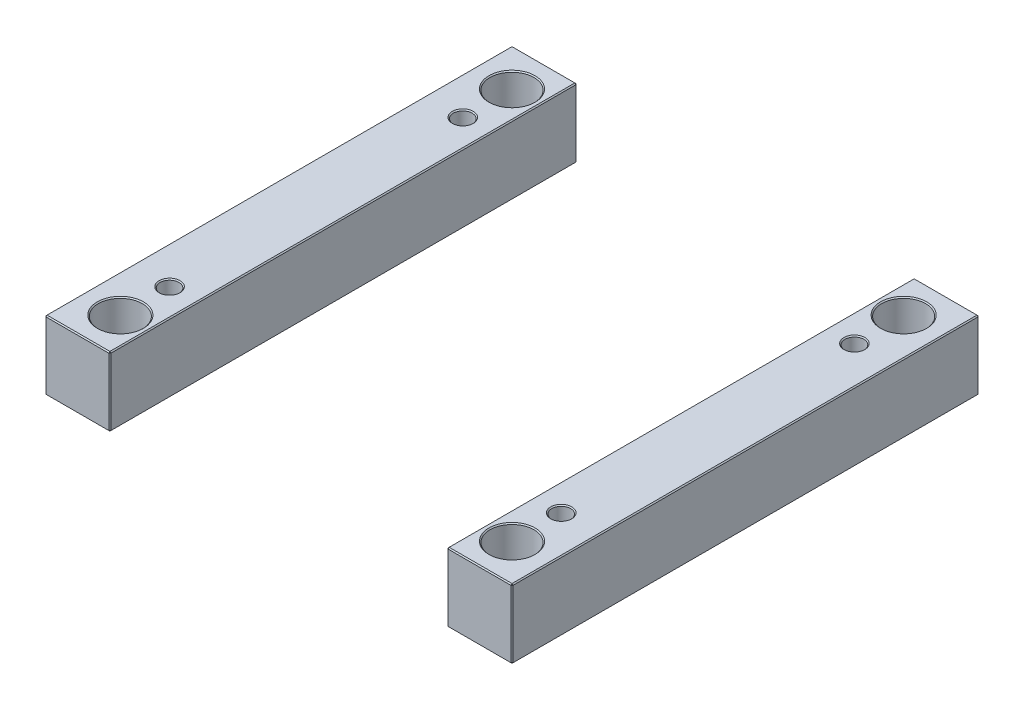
ISO-10303-21;
HEADER;
FILE_DESCRIPTION(('STEP AP214'),'2;1');
FILE_NAME('part.step','',(''),(''),'','','');
FILE_SCHEMA(('AUTOMOTIVE_DESIGN { 1 0 10303 214 1 1 1 1 }'));
ENDSEC;
DATA;
#1=APPLICATION_CONTEXT('core data for automotive mechanical design processes');
#2=APPLICATION_PROTOCOL_DEFINITION('international standard','automotive_design',2000,#1);
#3=PRODUCT_CONTEXT('',#1,'mechanical');
#4=PRODUCT('Part','Part','',(#3));
#5=PRODUCT_RELATED_PRODUCT_CATEGORY('part','',(#4));
#6=PRODUCT_DEFINITION_FORMATION('','',#4);
#7=PRODUCT_DEFINITION_CONTEXT('part definition',#1,'design');
#8=PRODUCT_DEFINITION('design','',#6,#7);
#9=PRODUCT_DEFINITION_SHAPE('','',#8);
#10=(LENGTH_UNIT() NAMED_UNIT(*) SI_UNIT(.MILLI.,.METRE.));
#11=(NAMED_UNIT(*) PLANE_ANGLE_UNIT() SI_UNIT($,.RADIAN.));
#12=(NAMED_UNIT(*) SI_UNIT($,.STERADIAN.) SOLID_ANGLE_UNIT());
#13=UNCERTAINTY_MEASURE_WITH_UNIT(LENGTH_MEASURE(1.E-05),#10,'distance_accuracy_value','');
#14=(GEOMETRIC_REPRESENTATION_CONTEXT(3) GLOBAL_UNCERTAINTY_ASSIGNED_CONTEXT((#13)) GLOBAL_UNIT_ASSIGNED_CONTEXT((#10,
#11,#12)) REPRESENTATION_CONTEXT('',''));
#15=CARTESIAN_POINT('',(0.,0.,0.));
#16=DIRECTION('',(0.,0.,1.));
#17=DIRECTION('',(1.,0.,0.));
#18=AXIS2_PLACEMENT_3D('',#15,#16,#17);
#19=CARTESIAN_POINT('',(-223.,66.,-223.));
#20=DIRECTION('',(0.,0.,1.));
#21=DIRECTION('',(1.,0.,0.));
#22=AXIS2_PLACEMENT_3D('',#19,#20,#21);
#23=PLANE('',#22);
#24=DIRECTION('',(-1.,0.,0.));
#25=VECTOR('',#24,1.);
#26=CARTESIAN_POINT('',(-223.,1.,-223.));
#27=LINE('',#26,#25);
#28=CARTESIAN_POINT('',(-162.,1.,-223.));
#29=VERTEX_POINT('',#28);
#30=CARTESIAN_POINT('',(-222.,1.,-223.));
#31=VERTEX_POINT('',#30);
#32=EDGE_CURVE('P0_E137',#29,#31,#27,.T.);
#33=ORIENTED_EDGE('',*,*,#32,.T.);
#34=DIRECTION('',(0.,1.,0.));
#35=VECTOR('',#34,1.);
#36=CARTESIAN_POINT('',(-222.,66.,-223.));
#37=LINE('',#36,#35);
#38=CARTESIAN_POINT('',(-222.,65.,-223.));
#39=VERTEX_POINT('',#38);
#40=EDGE_CURVE('P0_E265',#31,#39,#37,.T.);
#41=ORIENTED_EDGE('',*,*,#40,.T.);
#42=DIRECTION('',(1.,0.,0.));
#43=VECTOR('',#42,1.);
#44=CARTESIAN_POINT('',(-223.,65.,-223.));
#45=LINE('',#44,#43);
#46=CARTESIAN_POINT('',(-162.,65.,-223.));
#47=VERTEX_POINT('',#46);
#48=EDGE_CURVE('P0_E263',#39,#47,#45,.T.);
#49=ORIENTED_EDGE('',*,*,#48,.T.);
#50=DIRECTION('',(0.,-1.,0.));
#51=VECTOR('',#50,1.);
#52=CARTESIAN_POINT('',(-162.,66.,-223.));
#53=LINE('',#52,#51);
#54=EDGE_CURVE('P0_E260',#47,#29,#53,.T.);
#55=ORIENTED_EDGE('',*,*,#54,.T.);
#56=EDGE_LOOP('',(#33,#41,#49,#55));
#57=FACE_BOUND('',#56,.T.);
#58=ADVANCED_FACE('P0_F16',(#57),#23,.F.);
#59=CARTESIAN_POINT('',(-223.,66.,223.));
#60=DIRECTION('',(1.,0.,0.));
#61=DIRECTION('',(0.,0.,-1.));
#62=AXIS2_PLACEMENT_3D('',#59,#60,#61);
#63=PLANE('',#62);
#64=DIRECTION('',(0.,1.,0.));
#65=VECTOR('',#64,1.);
#66=CARTESIAN_POINT('',(-223.,66.,222.));
#67=LINE('',#66,#65);
#68=CARTESIAN_POINT('',(-223.,1.,222.));
#69=VERTEX_POINT('',#68);
#70=CARTESIAN_POINT('',(-223.,65.,222.));
#71=VERTEX_POINT('',#70);
#72=EDGE_CURVE('P0_E253',#69,#71,#67,.T.);
#73=ORIENTED_EDGE('',*,*,#72,.T.);
#74=DIRECTION('',(0.,0.,-1.));
#75=VECTOR('',#74,1.);
#76=CARTESIAN_POINT('',(-223.,65.,223.));
#77=LINE('',#76,#75);
#78=CARTESIAN_POINT('',(-223.,65.,-222.));
#79=VERTEX_POINT('',#78);
#80=EDGE_CURVE('P0_E258',#71,#79,#77,.T.);
#81=ORIENTED_EDGE('',*,*,#80,.T.);
#82=DIRECTION('',(0.,-1.,0.));
#83=VECTOR('',#82,1.);
#84=CARTESIAN_POINT('',(-223.,66.,-222.));
#85=LINE('',#84,#83);
#86=CARTESIAN_POINT('',(-223.,1.,-222.));
#87=VERTEX_POINT('',#86);
#88=EDGE_CURVE('P0_E255',#79,#87,#85,.T.);
#89=ORIENTED_EDGE('',*,*,#88,.T.);
#90=DIRECTION('',(0.,0.,1.));
#91=VECTOR('',#90,1.);
#92=CARTESIAN_POINT('',(-223.,1.,223.));
#93=LINE('',#92,#91);
#94=EDGE_CURVE('P0_E251',#87,#69,#93,.T.);
#95=ORIENTED_EDGE('',*,*,#94,.T.);
#96=EDGE_LOOP('',(#73,#81,#89,#95));
#97=FACE_BOUND('',#96,.T.);
#98=ADVANCED_FACE('P0_F333',(#97),#63,.F.);
#99=CARTESIAN_POINT('',(-223.,66.,223.));
#100=DIRECTION('',(0.,0.,-1.));
#101=DIRECTION('',(-1.,0.,0.));
#102=AXIS2_PLACEMENT_3D('',#99,#100,#101);
#103=PLANE('',#102);
#104=DIRECTION('',(-1.,0.,0.));
#105=VECTOR('',#104,1.);
#106=CARTESIAN_POINT('',(-223.,65.,223.));
#107=LINE('',#106,#105);
#108=CARTESIAN_POINT('',(-162.,65.,223.));
#109=VERTEX_POINT('',#108);
#110=CARTESIAN_POINT('',(-222.,65.,223.));
#111=VERTEX_POINT('',#110);
#112=EDGE_CURVE('P0_E272',#109,#111,#107,.T.);
#113=ORIENTED_EDGE('',*,*,#112,.T.);
#114=DIRECTION('',(0.,-1.,0.));
#115=VECTOR('',#114,1.);
#116=CARTESIAN_POINT('',(-222.,66.,223.));
#117=LINE('',#116,#115);
#118=CARTESIAN_POINT('',(-222.,1.,223.));
#119=VERTEX_POINT('',#118);
#120=EDGE_CURVE('P0_E274',#111,#119,#117,.T.);
#121=ORIENTED_EDGE('',*,*,#120,.T.);
#122=DIRECTION('',(1.,0.,0.));
#123=VECTOR('',#122,1.);
#124=CARTESIAN_POINT('',(-161.,1.,223.));
#125=LINE('',#124,#123);
#126=CARTESIAN_POINT('',(-162.,1.,223.));
#127=VERTEX_POINT('',#126);
#128=EDGE_CURVE('P0_E270',#119,#127,#125,.T.);
#129=ORIENTED_EDGE('',*,*,#128,.T.);
#130=DIRECTION('',(0.,1.,0.));
#131=VECTOR('',#130,1.);
#132=CARTESIAN_POINT('',(-162.,66.,223.));
#133=LINE('',#132,#131);
#134=EDGE_CURVE('P0_E268',#127,#109,#133,.T.);
#135=ORIENTED_EDGE('',*,*,#134,.T.);
#136=EDGE_LOOP('',(#113,#121,#129,#135));
#137=FACE_BOUND('',#136,.T.);
#138=ADVANCED_FACE('P0_F372',(#137),#103,.F.);
#139=CARTESIAN_POINT('',(-161.,66.,-223.));
#140=DIRECTION('',(-1.,0.,0.));
#141=DIRECTION('',(0.,0.,1.));
#142=AXIS2_PLACEMENT_3D('',#139,#140,#141);
#143=PLANE('',#142);
#144=DIRECTION('',(0.,0.,1.));
#145=VECTOR('',#144,1.);
#146=CARTESIAN_POINT('',(-161.,65.,-223.));
#147=LINE('',#146,#145);
#148=CARTESIAN_POINT('',(-161.,65.,-222.));
#149=VERTEX_POINT('',#148);
#150=CARTESIAN_POINT('',(-161.,65.,222.));
#151=VERTEX_POINT('',#150);
#152=EDGE_CURVE('P0_E31',#149,#151,#147,.T.);
#153=ORIENTED_EDGE('',*,*,#152,.T.);
#154=DIRECTION('',(0.,-1.,0.));
#155=VECTOR('',#154,1.);
#156=CARTESIAN_POINT('',(-161.,66.,222.));
#157=LINE('',#156,#155);
#158=CARTESIAN_POINT('',(-161.,1.,222.));
#159=VERTEX_POINT('',#158);
#160=EDGE_CURVE('P0_E190',#151,#159,#157,.T.);
#161=ORIENTED_EDGE('',*,*,#160,.T.);
#162=DIRECTION('',(0.,0.,-1.));
#163=VECTOR('',#162,1.);
#164=CARTESIAN_POINT('',(-161.,1.,-223.));
#165=LINE('',#164,#163);
#166=CARTESIAN_POINT('',(-161.,1.,-222.));
#167=VERTEX_POINT('',#166);
#168=EDGE_CURVE('P0_E286',#159,#167,#165,.T.);
#169=ORIENTED_EDGE('',*,*,#168,.T.);
#170=DIRECTION('',(0.,1.,0.));
#171=VECTOR('',#170,1.);
#172=CARTESIAN_POINT('',(-161.,66.,-222.));
#173=LINE('',#172,#171);
#174=EDGE_CURVE('P0_E36',#167,#149,#173,.T.);
#175=ORIENTED_EDGE('',*,*,#174,.T.);
#176=EDGE_LOOP('',(#153,#161,#169,#175));
#177=FACE_BOUND('',#176,.T.);
#178=ADVANCED_FACE('P0_F649',(#177),#143,.F.);
#179=CARTESIAN_POINT('',(0.,66.,0.));
#180=DIRECTION('',(0.,-1.,0.));
#181=DIRECTION('',(0.,0.,-1.));
#182=AXIS2_PLACEMENT_3D('',#179,#180,#181);
#183=PLANE('',#182);
#184=CARTESIAN_POINT('',(-187.,66.,-187.));
#185=DIRECTION('',(0.,-1.,0.));
#186=DIRECTION('',(0.,0.,-1.));
#187=AXIS2_PLACEMENT_3D('',#184,#185,#186);
#188=CIRCLE('',#187,22.);
#189=CARTESIAN_POINT('',(-187.,66.,-209.));
#190=VERTEX_POINT('',#189);
#191=EDGE_CURVE('P0_E214',#190,#190,#188,.T.);
#192=ORIENTED_EDGE('',*,*,#191,.T.);
#193=EDGE_LOOP('',(#192));
#194=FACE_BOUND('',#193,.T.);
#195=CARTESIAN_POINT('',(-187.,66.,187.));
#196=DIRECTION('',(0.,-1.,0.));
#197=DIRECTION('',(0.,0.,-1.));
#198=AXIS2_PLACEMENT_3D('',#195,#196,#197);
#199=CIRCLE('',#198,22.);
#200=CARTESIAN_POINT('',(-187.,66.,165.));
#201=VERTEX_POINT('',#200);
#202=EDGE_CURVE('P0_E211',#201,#201,#199,.T.);
#203=ORIENTED_EDGE('',*,*,#202,.T.);
#204=EDGE_LOOP('',(#203));
#205=FACE_BOUND('',#204,.T.);
#206=CARTESIAN_POINT('',(-187.,66.,140.));
#207=DIRECTION('',(0.,-1.,0.));
#208=DIRECTION('',(0.,0.,-1.));
#209=AXIS2_PLACEMENT_3D('',#206,#207,#208);
#210=CIRCLE('',#209,10.);
#211=CARTESIAN_POINT('',(-187.,66.,130.));
#212=VERTEX_POINT('',#211);
#213=EDGE_CURVE('P0_E193',#212,#212,#210,.T.);
#214=ORIENTED_EDGE('',*,*,#213,.T.);
#215=EDGE_LOOP('',(#214));
#216=FACE_BOUND('',#215,.T.);
#217=CARTESIAN_POINT('',(-187.,66.,-140.));
#218=DIRECTION('',(0.,-1.,0.));
#219=DIRECTION('',(0.,0.,-1.));
#220=AXIS2_PLACEMENT_3D('',#217,#218,#219);
#221=CIRCLE('',#220,10.);
#222=CARTESIAN_POINT('',(-187.,66.,-150.));
#223=VERTEX_POINT('',#222);
#224=EDGE_CURVE('P0_E189',#223,#223,#221,.T.);
#225=ORIENTED_EDGE('',*,*,#224,.T.);
#226=EDGE_LOOP('',(#225));
#227=FACE_BOUND('',#226,.T.);
#228=DIRECTION('',(0.,0.,1.));
#229=VECTOR('',#228,1.);
#230=CARTESIAN_POINT('',(-222.,66.,1.38155555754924E-13));
#231=LINE('',#230,#229);
#232=CARTESIAN_POINT('',(-222.,66.,-222.));
#233=VERTEX_POINT('',#232);
#234=CARTESIAN_POINT('',(-222.,66.,222.));
#235=VERTEX_POINT('',#234);
#236=EDGE_CURVE('P0_E281',#233,#235,#231,.T.);
#237=ORIENTED_EDGE('',*,*,#236,.T.);
#238=DIRECTION('',(1.,0.,0.));
#239=VECTOR('',#238,1.);
#240=CARTESIAN_POINT('',(-1.9876573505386E-13,66.,222.));
#241=LINE('',#240,#239);
#242=CARTESIAN_POINT('',(-162.,66.,222.));
#243=VERTEX_POINT('',#242);
#244=EDGE_CURVE('P0_E283',#235,#243,#241,.T.);
#245=ORIENTED_EDGE('',*,*,#244,.T.);
#246=DIRECTION('',(0.,0.,-1.));
#247=VECTOR('',#246,1.);
#248=CARTESIAN_POINT('',(-162.,66.,0.));
#249=LINE('',#248,#247);
#250=CARTESIAN_POINT('',(-162.,66.,-222.));
#251=VERTEX_POINT('',#250);
#252=EDGE_CURVE('P0_E277',#243,#251,#249,.T.);
#253=ORIENTED_EDGE('',*,*,#252,.T.);
#254=DIRECTION('',(-1.,0.,0.));
#255=VECTOR('',#254,1.);
#256=CARTESIAN_POINT('',(2.98148602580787E-13,66.,-222.));
#257=LINE('',#256,#255);
#258=EDGE_CURVE('P0_E279',#251,#233,#257,.T.);
#259=ORIENTED_EDGE('',*,*,#258,.T.);
#260=EDGE_LOOP('',(#237,#245,#253,#259));
#261=FACE_BOUND('',#260,.T.);
#262=ADVANCED_FACE('P0_F229',(#194,#205,#216,#227,#261),#183,.F.);
#263=CARTESIAN_POINT('',(0.,0.,0.));
#264=DIRECTION('',(0.,-1.,0.));
#265=DIRECTION('',(0.,0.,-1.));
#266=AXIS2_PLACEMENT_3D('',#263,#264,#265);
#267=PLANE('',#266);
#268=CARTESIAN_POINT('',(-187.,0.,-187.));
#269=DIRECTION('',(0.,-1.,0.));
#270=DIRECTION('',(0.,0.,-1.));
#271=AXIS2_PLACEMENT_3D('',#268,#269,#270);
#272=CIRCLE('',#271,22.);
#273=CARTESIAN_POINT('',(-187.,0.,-209.));
#274=VERTEX_POINT('',#273);
#275=EDGE_CURVE('P0_E202',#274,#274,#272,.F.);
#276=ORIENTED_EDGE('',*,*,#275,.T.);
#277=EDGE_LOOP('',(#276));
#278=FACE_BOUND('',#277,.T.);
#279=CARTESIAN_POINT('',(-187.,0.,187.));
#280=DIRECTION('',(0.,-1.,0.));
#281=DIRECTION('',(0.,0.,-1.));
#282=AXIS2_PLACEMENT_3D('',#279,#280,#281);
#283=CIRCLE('',#282,22.);
#284=CARTESIAN_POINT('',(-187.,0.,165.));
#285=VERTEX_POINT('',#284);
#286=EDGE_CURVE('P0_E199',#285,#285,#283,.F.);
#287=ORIENTED_EDGE('',*,*,#286,.T.);
#288=EDGE_LOOP('',(#287));
#289=FACE_BOUND('',#288,.T.);
#290=CARTESIAN_POINT('',(-187.,0.,-140.));
#291=DIRECTION('',(0.,-1.,0.));
#292=DIRECTION('',(0.,0.,-1.));
#293=AXIS2_PLACEMENT_3D('',#290,#291,#292);
#294=CIRCLE('',#293,10.);
#295=CARTESIAN_POINT('',(-187.,0.,-150.));
#296=VERTEX_POINT('',#295);
#297=EDGE_CURVE('P0_E235',#296,#296,#294,.F.);
#298=ORIENTED_EDGE('',*,*,#297,.T.);
#299=EDGE_LOOP('',(#298));
#300=FACE_BOUND('',#299,.T.);
#301=CARTESIAN_POINT('',(-187.,0.,140.));
#302=DIRECTION('',(0.,-1.,0.));
#303=DIRECTION('',(0.,0.,-1.));
#304=AXIS2_PLACEMENT_3D('',#301,#302,#303);
#305=CIRCLE('',#304,10.);
#306=CARTESIAN_POINT('',(-187.,0.,130.));
#307=VERTEX_POINT('',#306);
#308=EDGE_CURVE('P0_E238',#307,#307,#305,.F.);
#309=ORIENTED_EDGE('',*,*,#308,.T.);
#310=EDGE_LOOP('',(#309));
#311=FACE_BOUND('',#310,.T.);
#312=DIRECTION('',(-1.,0.,0.));
#313=VECTOR('',#312,1.);
#314=CARTESIAN_POINT('',(-223.,0.,222.));
#315=LINE('',#314,#313);
#316=CARTESIAN_POINT('',(-162.,0.,222.));
#317=VERTEX_POINT('',#316);
#318=CARTESIAN_POINT('',(-222.,0.,222.));
#319=VERTEX_POINT('',#318);
#320=EDGE_CURVE('P0_E114',#317,#319,#315,.T.);
#321=ORIENTED_EDGE('',*,*,#320,.T.);
#322=DIRECTION('',(0.,0.,-1.));
#323=VECTOR('',#322,1.);
#324=CARTESIAN_POINT('',(-222.,0.,-223.));
#325=LINE('',#324,#323);
#326=CARTESIAN_POINT('',(-222.,0.,-222.));
#327=VERTEX_POINT('',#326);
#328=EDGE_CURVE('P0_E110',#319,#327,#325,.T.);
#329=ORIENTED_EDGE('',*,*,#328,.T.);
#330=DIRECTION('',(1.,0.,0.));
#331=VECTOR('',#330,1.);
#332=CARTESIAN_POINT('',(-161.,0.,-222.));
#333=LINE('',#332,#331);
#334=CARTESIAN_POINT('',(-162.,0.,-222.));
#335=VERTEX_POINT('',#334);
#336=EDGE_CURVE('P0_E104',#327,#335,#333,.T.);
#337=ORIENTED_EDGE('',*,*,#336,.T.);
#338=DIRECTION('',(0.,0.,1.));
#339=VECTOR('',#338,1.);
#340=CARTESIAN_POINT('',(-162.,0.,223.));
#341=LINE('',#340,#339);
#342=EDGE_CURVE('P0_E107',#335,#317,#341,.T.);
#343=ORIENTED_EDGE('',*,*,#342,.T.);
#344=EDGE_LOOP('',(#321,#329,#337,#343));
#345=FACE_BOUND('',#344,.T.);
#346=ADVANCED_FACE('P0_F106',(#278,#289,#300,#311,#345),#267,.T.);
#347=CARTESIAN_POINT('',(-187.,0.,-140.));
#348=DIRECTION('',(0.,1.,0.));
#349=DIRECTION('',(0.,0.,1.));
#350=AXIS2_PLACEMENT_3D('',#347,#348,#349);
#351=CYLINDRICAL_SURFACE('',#350,9.);
#352=CARTESIAN_POINT('',(-187.,65.,-140.));
#353=DIRECTION('',(0.,-1.,0.));
#354=DIRECTION('',(0.,0.,-1.));
#355=AXIS2_PLACEMENT_3D('',#352,#353,#354);
#356=CIRCLE('',#355,9.);
#357=CARTESIAN_POINT('',(-187.,65.,-149.));
#358=VERTEX_POINT('',#357);
#359=EDGE_CURVE('P0_E196',#358,#358,#356,.F.);
#360=ORIENTED_EDGE('',*,*,#359,.T.);
#361=EDGE_LOOP('',(#360));
#362=FACE_BOUND('',#361,.T.);
#363=CARTESIAN_POINT('',(-187.,0.999999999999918,-140.));
#364=DIRECTION('',(0.,-1.,0.));
#365=DIRECTION('',(0.,0.,-1.));
#366=AXIS2_PLACEMENT_3D('',#363,#364,#365);
#367=CIRCLE('',#366,9.);
#368=CARTESIAN_POINT('',(-187.,0.999999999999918,-149.));
#369=VERTEX_POINT('',#368);
#370=EDGE_CURVE('P0_E241',#369,#369,#367,.T.);
#371=ORIENTED_EDGE('',*,*,#370,.T.);
#372=EDGE_LOOP('',(#371));
#373=FACE_BOUND('',#372,.T.);
#374=ADVANCED_FACE('P0_F228',(#362,#373),#351,.F.);
#375=CARTESIAN_POINT('',(-187.,0.,140.));
#376=DIRECTION('',(0.,1.,0.));
#377=DIRECTION('',(0.,0.,1.));
#378=AXIS2_PLACEMENT_3D('',#375,#376,#377);
#379=CYLINDRICAL_SURFACE('',#378,9.);
#380=CARTESIAN_POINT('',(-187.,65.,140.));
#381=DIRECTION('',(0.,-1.,0.));
#382=DIRECTION('',(0.,0.,-1.));
#383=AXIS2_PLACEMENT_3D('',#380,#381,#382);
#384=CIRCLE('',#383,9.);
#385=CARTESIAN_POINT('',(-187.,65.,131.));
#386=VERTEX_POINT('',#385);
#387=EDGE_CURVE('P0_E186',#386,#386,#384,.F.);
#388=ORIENTED_EDGE('',*,*,#387,.T.);
#389=EDGE_LOOP('',(#388));
#390=FACE_BOUND('',#389,.T.);
#391=CARTESIAN_POINT('',(-187.,0.999999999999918,140.));
#392=DIRECTION('',(0.,-1.,0.));
#393=DIRECTION('',(0.,0.,-1.));
#394=AXIS2_PLACEMENT_3D('',#391,#392,#393);
#395=CIRCLE('',#394,9.);
#396=CARTESIAN_POINT('',(-187.,0.999999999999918,131.));
#397=VERTEX_POINT('',#396);
#398=EDGE_CURVE('P0_E248',#397,#397,#395,.T.);
#399=ORIENTED_EDGE('',*,*,#398,.T.);
#400=EDGE_LOOP('',(#399));
#401=FACE_BOUND('',#400,.T.);
#402=ADVANCED_FACE('P0_F380',(#390,#401),#379,.F.);
#403=CARTESIAN_POINT('',(-187.,0.,-140.));
#404=DIRECTION('',(0.,-1.,0.));
#405=DIRECTION('',(0.,0.,-1.));
#406=AXIS2_PLACEMENT_3D('',#403,#404,#405);
#407=CONICAL_SURFACE('',#406,10.,0.78539816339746);
#408=ORIENTED_EDGE('',*,*,#370,.F.);
#409=EDGE_LOOP('',(#408));
#410=FACE_BOUND('',#409,.T.);
#411=ORIENTED_EDGE('',*,*,#297,.F.);
#412=EDGE_LOOP('',(#411));
#413=FACE_BOUND('',#412,.T.);
#414=ADVANCED_FACE('P0_F376',(#410,#413),#407,.F.);
#415=CARTESIAN_POINT('',(-187.,0.,140.));
#416=DIRECTION('',(0.,-1.,0.));
#417=DIRECTION('',(0.,0.,-1.));
#418=AXIS2_PLACEMENT_3D('',#415,#416,#417);
#419=CONICAL_SURFACE('',#418,10.,0.78539816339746);
#420=ORIENTED_EDGE('',*,*,#398,.F.);
#421=EDGE_LOOP('',(#420));
#422=FACE_BOUND('',#421,.T.);
#423=ORIENTED_EDGE('',*,*,#308,.F.);
#424=EDGE_LOOP('',(#423));
#425=FACE_BOUND('',#424,.T.);
#426=ADVANCED_FACE('P0_F379',(#422,#425),#419,.F.);
#427=CARTESIAN_POINT('',(-161.,66.,222.));
#428=DIRECTION('',(-0.707106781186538,0.,-0.707106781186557));
#429=DIRECTION('',(0.,-1.,0.));
#430=AXIS2_PLACEMENT_3D('',#427,#428,#429);
#431=PLANE('',#430);
#432=DIRECTION('',(-0.707106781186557,0.,0.707106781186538));
#433=VECTOR('',#432,1.);
#434=CARTESIAN_POINT('',(-161.5,65.,222.5));
#435=LINE('',#434,#433);
#436=EDGE_CURVE('P0_E125',#109,#151,#435,.F.);
#437=ORIENTED_EDGE('',*,*,#436,.F.);
#438=ORIENTED_EDGE('',*,*,#134,.F.);
#439=DIRECTION('',(0.707106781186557,0.,-0.707106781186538));
#440=VECTOR('',#439,1.);
#441=CARTESIAN_POINT('',(-162.,1.,223.));
#442=LINE('',#441,#440);
#443=EDGE_CURVE('P0_E181',#159,#127,#442,.F.);
#444=ORIENTED_EDGE('',*,*,#443,.F.);
#445=ORIENTED_EDGE('',*,*,#160,.F.);
#446=EDGE_LOOP('',(#437,#438,#444,#445));
#447=FACE_BOUND('',#446,.T.);
#448=ADVANCED_FACE('P0_F384',(#447),#431,.F.);
#449=CARTESIAN_POINT('',(-162.,66.,222.));
#450=DIRECTION('',(0.577350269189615,0.577350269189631,0.577350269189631));
#451=DIRECTION('',(0.,-0.707106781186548,0.707106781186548));
#452=AXIS2_PLACEMENT_3D('',#449,#450,#451);
#453=PLANE('',#452);
#454=DIRECTION('',(0.,0.707106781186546,-0.707106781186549));
#455=VECTOR('',#454,1.);
#456=CARTESIAN_POINT('',(-162.,66.,222.));
#457=LINE('',#456,#455);
#458=EDGE_CURVE('P0_E175',#109,#243,#457,.T.);
#459=ORIENTED_EDGE('',*,*,#458,.F.);
#460=ORIENTED_EDGE('',*,*,#436,.T.);
#461=DIRECTION('',(0.707106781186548,-0.707106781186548,0.));
#462=VECTOR('',#461,1.);
#463=CARTESIAN_POINT('',(-162.,66.,222.));
#464=LINE('',#463,#462);
#465=EDGE_CURVE('P0_E178',#243,#151,#464,.T.);
#466=ORIENTED_EDGE('',*,*,#465,.F.);
#467=EDGE_LOOP('',(#459,#460,#466));
#468=FACE_BOUND('',#467,.T.);
#469=ADVANCED_FACE('P0_F588',(#468),#453,.T.);
#470=CARTESIAN_POINT('',(-162.,1.,223.));
#471=DIRECTION('',(0.577350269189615,-0.577350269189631,0.577350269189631));
#472=DIRECTION('',(0.,-0.707106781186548,-0.707106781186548));
#473=AXIS2_PLACEMENT_3D('',#470,#471,#472);
#474=PLANE('',#473);
#475=DIRECTION('',(0.707106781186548,0.707106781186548,0.));
#476=VECTOR('',#475,1.);
#477=CARTESIAN_POINT('',(-161.5,0.500000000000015,222.));
#478=LINE('',#477,#476);
#479=EDGE_CURVE('P0_E123',#159,#317,#478,.F.);
#480=ORIENTED_EDGE('',*,*,#479,.F.);
#481=ORIENTED_EDGE('',*,*,#443,.T.);
#482=DIRECTION('',(0.,-0.707106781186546,-0.707106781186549));
#483=VECTOR('',#482,1.);
#484=CARTESIAN_POINT('',(-162.,1.,223.));
#485=LINE('',#484,#483);
#486=EDGE_CURVE('P0_E172',#317,#127,#485,.F.);
#487=ORIENTED_EDGE('',*,*,#486,.F.);
#488=EDGE_LOOP('',(#480,#481,#487));
#489=FACE_BOUND('',#488,.T.);
#490=ADVANCED_FACE('P0_F597',(#489),#474,.T.);
#491=CARTESIAN_POINT('',(-162.,66.,0.));
#492=DIRECTION('',(-0.707106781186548,-0.707106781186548,0.));
#493=DIRECTION('',(0.,0.,-1.));
#494=AXIS2_PLACEMENT_3D('',#491,#492,#493);
#495=PLANE('',#494);
#496=ORIENTED_EDGE('',*,*,#465,.T.);
#497=ORIENTED_EDGE('',*,*,#152,.F.);
#498=DIRECTION('',(-0.707106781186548,0.707106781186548,0.));
#499=VECTOR('',#498,1.);
#500=CARTESIAN_POINT('',(-161.5,65.5,-222.));
#501=LINE('',#500,#499);
#502=EDGE_CURVE('P0_E165',#251,#149,#501,.F.);
#503=ORIENTED_EDGE('',*,*,#502,.F.);
#504=ORIENTED_EDGE('',*,*,#252,.F.);
#505=EDGE_LOOP('',(#496,#497,#503,#504));
#506=FACE_BOUND('',#505,.T.);
#507=ADVANCED_FACE('P0_F349',(#506),#495,.F.);
#508=CARTESIAN_POINT('',(-1.9876573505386E-13,66.,222.));
#509=DIRECTION('',(0.,-0.707106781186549,-0.707106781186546));
#510=DIRECTION('',(1.,0.,0.));
#511=AXIS2_PLACEMENT_3D('',#508,#509,#510);
#512=PLANE('',#511);
#513=ORIENTED_EDGE('',*,*,#458,.T.);
#514=ORIENTED_EDGE('',*,*,#244,.F.);
#515=DIRECTION('',(0.,-0.707106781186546,0.707106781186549));
#516=VECTOR('',#515,1.);
#517=CARTESIAN_POINT('',(-222.,65.5,222.5));
#518=LINE('',#517,#516);
#519=EDGE_CURVE('P0_E162',#111,#235,#518,.F.);
#520=ORIENTED_EDGE('',*,*,#519,.F.);
#521=ORIENTED_EDGE('',*,*,#112,.F.);
#522=EDGE_LOOP('',(#513,#514,#520,#521));
#523=FACE_BOUND('',#522,.T.);
#524=ADVANCED_FACE('P0_F344',(#523),#512,.F.);
#525=CARTESIAN_POINT('',(-222.,66.,223.));
#526=DIRECTION('',(0.707106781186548,0.,-0.707106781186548));
#527=DIRECTION('',(0.,-1.,0.));
#528=AXIS2_PLACEMENT_3D('',#525,#526,#527);
#529=PLANE('',#528);
#530=DIRECTION('',(0.707106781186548,0.,0.707106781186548));
#531=VECTOR('',#530,1.);
#532=CARTESIAN_POINT('',(-222.,1.,223.));
#533=LINE('',#532,#531);
#534=EDGE_CURVE('P0_E156',#119,#69,#533,.F.);
#535=ORIENTED_EDGE('',*,*,#534,.F.);
#536=ORIENTED_EDGE('',*,*,#120,.F.);
#537=DIRECTION('',(-0.707106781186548,0.,-0.707106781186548));
#538=VECTOR('',#537,1.);
#539=CARTESIAN_POINT('',(-223.,65.,222.));
#540=LINE('',#539,#538);
#541=EDGE_CURVE('P0_E159',#71,#111,#540,.F.);
#542=ORIENTED_EDGE('',*,*,#541,.F.);
#543=ORIENTED_EDGE('',*,*,#72,.F.);
#544=EDGE_LOOP('',(#535,#536,#542,#543));
#545=FACE_BOUND('',#544,.T.);
#546=ADVANCED_FACE('P0_F338',(#545),#529,.F.);
#547=CARTESIAN_POINT('',(-223.,1.,223.));
#548=DIRECTION('',(0.,-0.707106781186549,0.707106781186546));
#549=DIRECTION('',(-1.,0.,0.));
#550=AXIS2_PLACEMENT_3D('',#547,#548,#549);
#551=PLANE('',#550);
#552=ORIENTED_EDGE('',*,*,#486,.T.);
#553=ORIENTED_EDGE('',*,*,#128,.F.);
#554=DIRECTION('',(0.,0.707106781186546,0.707106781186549));
#555=VECTOR('',#554,1.);
#556=CARTESIAN_POINT('',(-222.,1.,223.));
#557=LINE('',#556,#555);
#558=EDGE_CURVE('P0_E134',#319,#119,#557,.T.);
#559=ORIENTED_EDGE('',*,*,#558,.F.);
#560=ORIENTED_EDGE('',*,*,#320,.F.);
#561=EDGE_LOOP('',(#552,#553,#559,#560));
#562=FACE_BOUND('',#561,.T.);
#563=ADVANCED_FACE('P0_F364',(#562),#551,.T.);
#564=CARTESIAN_POINT('',(-161.,1.,-223.));
#565=DIRECTION('',(0.707106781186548,-0.707106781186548,0.));
#566=DIRECTION('',(0.,0.,1.));
#567=AXIS2_PLACEMENT_3D('',#564,#565,#566);
#568=PLANE('',#567);
#569=ORIENTED_EDGE('',*,*,#479,.T.);
#570=ORIENTED_EDGE('',*,*,#342,.F.);
#571=DIRECTION('',(-0.707106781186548,-0.707106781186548,0.));
#572=VECTOR('',#571,1.);
#573=CARTESIAN_POINT('',(-162.,0.,-222.));
#574=LINE('',#573,#572);
#575=EDGE_CURVE('P0_E120',#167,#335,#574,.T.);
#576=ORIENTED_EDGE('',*,*,#575,.F.);
#577=ORIENTED_EDGE('',*,*,#168,.F.);
#578=EDGE_LOOP('',(#569,#570,#576,#577));
#579=FACE_BOUND('',#578,.T.);
#580=ADVANCED_FACE('P0_F119',(#579),#568,.T.);
#581=CARTESIAN_POINT('',(-162.,66.,-223.));
#582=DIRECTION('',(-0.707106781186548,0.,0.707106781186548));
#583=DIRECTION('',(0.,-1.,0.));
#584=AXIS2_PLACEMENT_3D('',#581,#582,#583);
#585=PLANE('',#584);
#586=DIRECTION('',(0.707106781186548,0.,0.707106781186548));
#587=VECTOR('',#586,1.);
#588=CARTESIAN_POINT('',(-162.,65.,-223.));
#589=LINE('',#588,#587);
#590=EDGE_CURVE('P0_E168',#149,#47,#589,.F.);
#591=ORIENTED_EDGE('',*,*,#590,.F.);
#592=ORIENTED_EDGE('',*,*,#174,.F.);
#593=DIRECTION('',(-0.707106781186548,0.,-0.707106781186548));
#594=VECTOR('',#593,1.);
#595=CARTESIAN_POINT('',(-161.5,1.,-222.5));
#596=LINE('',#595,#594);
#597=EDGE_CURVE('P0_E133',#29,#167,#596,.F.);
#598=ORIENTED_EDGE('',*,*,#597,.F.);
#599=ORIENTED_EDGE('',*,*,#54,.F.);
#600=EDGE_LOOP('',(#591,#592,#598,#599));
#601=FACE_BOUND('',#600,.T.);
#602=ADVANCED_FACE('P0_F354',(#601),#585,.F.);
#603=CARTESIAN_POINT('',(-162.,65.,-223.));
#604=DIRECTION('',(0.577350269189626,0.577350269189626,-0.577350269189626));
#605=DIRECTION('',(-0.707106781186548,0.,-0.707106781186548));
#606=AXIS2_PLACEMENT_3D('',#603,#604,#605);
#607=PLANE('',#606);
#608=ORIENTED_EDGE('',*,*,#502,.T.);
#609=ORIENTED_EDGE('',*,*,#590,.T.);
#610=DIRECTION('',(0.,-0.707106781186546,-0.70710678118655));
#611=VECTOR('',#610,1.);
#612=CARTESIAN_POINT('',(-162.,65.,-223.));
#613=LINE('',#612,#611);
#614=EDGE_CURVE('P0_E151',#251,#47,#613,.T.);
#615=ORIENTED_EDGE('',*,*,#614,.F.);
#616=EDGE_LOOP('',(#608,#609,#615));
#617=FACE_BOUND('',#616,.T.);
#618=ADVANCED_FACE('P0_F352',(#617),#607,.T.);
#619=CARTESIAN_POINT('',(-223.,65.,222.));
#620=DIRECTION('',(-0.577350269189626,0.577350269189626,0.577350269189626));
#621=DIRECTION('',(0.707106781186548,0.,0.707106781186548));
#622=AXIS2_PLACEMENT_3D('',#619,#620,#621);
#623=PLANE('',#622);
#624=ORIENTED_EDGE('',*,*,#541,.T.);
#625=ORIENTED_EDGE('',*,*,#519,.T.);
#626=DIRECTION('',(0.707106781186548,0.707106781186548,0.));
#627=VECTOR('',#626,1.);
#628=CARTESIAN_POINT('',(-223.,65.,222.));
#629=LINE('',#628,#627);
#630=EDGE_CURVE('P0_E142',#71,#235,#629,.T.);
#631=ORIENTED_EDGE('',*,*,#630,.F.);
#632=EDGE_LOOP('',(#624,#625,#631));
#633=FACE_BOUND('',#632,.T.);
#634=ADVANCED_FACE('P0_F341',(#633),#623,.T.);
#635=CARTESIAN_POINT('',(-222.,1.,223.));
#636=DIRECTION('',(-0.577350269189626,-0.577350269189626,0.577350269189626));
#637=DIRECTION('',(0.707106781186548,0.,0.707106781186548));
#638=AXIS2_PLACEMENT_3D('',#635,#636,#637);
#639=PLANE('',#638);
#640=ORIENTED_EDGE('',*,*,#558,.T.);
#641=ORIENTED_EDGE('',*,*,#534,.T.);
#642=DIRECTION('',(0.707106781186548,-0.707106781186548,0.));
#643=VECTOR('',#642,1.);
#644=CARTESIAN_POINT('',(-222.5,0.5,222.));
#645=LINE('',#644,#643);
#646=EDGE_CURVE('P0_E138',#319,#69,#645,.F.);
#647=ORIENTED_EDGE('',*,*,#646,.F.);
#648=EDGE_LOOP('',(#640,#641,#647));
#649=FACE_BOUND('',#648,.T.);
#650=ADVANCED_FACE('P0_F403',(#649),#639,.T.);
#651=CARTESIAN_POINT('',(-162.,0.,-222.));
#652=DIRECTION('',(0.577350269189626,-0.577350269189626,-0.577350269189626));
#653=DIRECTION('',(-0.707106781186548,0.,-0.707106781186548));
#654=AXIS2_PLACEMENT_3D('',#651,#652,#653);
#655=PLANE('',#654);
#656=ORIENTED_EDGE('',*,*,#597,.T.);
#657=ORIENTED_EDGE('',*,*,#575,.T.);
#658=DIRECTION('',(0.,0.707106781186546,-0.70710678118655));
#659=VECTOR('',#658,1.);
#660=CARTESIAN_POINT('',(-162.,0.,-222.));
#661=LINE('',#660,#659);
#662=EDGE_CURVE('P0_E130',#29,#335,#661,.F.);
#663=ORIENTED_EDGE('',*,*,#662,.F.);
#664=EDGE_LOOP('',(#656,#657,#663));
#665=FACE_BOUND('',#664,.T.);
#666=ADVANCED_FACE('P0_F129',(#665),#655,.T.);
#667=CARTESIAN_POINT('',(2.98148602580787E-13,66.,-222.));
#668=DIRECTION('',(0.,-0.70710678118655,0.707106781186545));
#669=DIRECTION('',(-1.,0.,0.));
#670=AXIS2_PLACEMENT_3D('',#667,#668,#669);
#671=PLANE('',#670);
#672=ORIENTED_EDGE('',*,*,#614,.T.);
#673=ORIENTED_EDGE('',*,*,#48,.F.);
#674=DIRECTION('',(0.,0.707106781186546,0.707106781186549));
#675=VECTOR('',#674,1.);
#676=CARTESIAN_POINT('',(-222.,65.,-223.));
#677=LINE('',#676,#675);
#678=EDGE_CURVE('P0_E139',#233,#39,#677,.F.);
#679=ORIENTED_EDGE('',*,*,#678,.F.);
#680=ORIENTED_EDGE('',*,*,#258,.F.);
#681=EDGE_LOOP('',(#672,#673,#679,#680));
#682=FACE_BOUND('',#681,.T.);
#683=ADVANCED_FACE('P0_F316',(#682),#671,.F.);
#684=CARTESIAN_POINT('',(-222.,66.,1.38155555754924E-13));
#685=DIRECTION('',(0.707106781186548,-0.707106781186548,0.));
#686=DIRECTION('',(0.,0.,1.));
#687=AXIS2_PLACEMENT_3D('',#684,#685,#686);
#688=PLANE('',#687);
#689=ORIENTED_EDGE('',*,*,#630,.T.);
#690=ORIENTED_EDGE('',*,*,#236,.F.);
#691=DIRECTION('',(-0.707106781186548,-0.707106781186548,0.));
#692=VECTOR('',#691,1.);
#693=CARTESIAN_POINT('',(-222.5,65.5,-222.));
#694=LINE('',#693,#692);
#695=EDGE_CURVE('P0_E145',#79,#233,#694,.F.);
#696=ORIENTED_EDGE('',*,*,#695,.F.);
#697=ORIENTED_EDGE('',*,*,#80,.F.);
#698=EDGE_LOOP('',(#689,#690,#696,#697));
#699=FACE_BOUND('',#698,.T.);
#700=ADVANCED_FACE('P0_F310',(#699),#688,.F.);
#701=CARTESIAN_POINT('',(-223.,1.,223.));
#702=DIRECTION('',(-0.707106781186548,-0.707106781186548,0.));
#703=DIRECTION('',(0.,0.,-1.));
#704=AXIS2_PLACEMENT_3D('',#701,#702,#703);
#705=PLANE('',#704);
#706=ORIENTED_EDGE('',*,*,#646,.T.);
#707=ORIENTED_EDGE('',*,*,#94,.F.);
#708=DIRECTION('',(-0.707106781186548,0.707106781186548,0.));
#709=VECTOR('',#708,1.);
#710=CARTESIAN_POINT('',(-223.,1.,-222.));
#711=LINE('',#710,#709);
#712=EDGE_CURVE('P0_E297',#327,#87,#711,.T.);
#713=ORIENTED_EDGE('',*,*,#712,.F.);
#714=ORIENTED_EDGE('',*,*,#328,.F.);
#715=EDGE_LOOP('',(#706,#707,#713,#714));
#716=FACE_BOUND('',#715,.T.);
#717=ADVANCED_FACE('P0_F329',(#716),#705,.T.);
#718=CARTESIAN_POINT('',(-223.,1.,-223.));
#719=DIRECTION('',(0.,-0.70710678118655,-0.707106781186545));
#720=DIRECTION('',(1.,0.,0.));
#721=AXIS2_PLACEMENT_3D('',#718,#719,#720);
#722=PLANE('',#721);
#723=ORIENTED_EDGE('',*,*,#662,.T.);
#724=ORIENTED_EDGE('',*,*,#336,.F.);
#725=DIRECTION('',(0.,-0.707106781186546,0.707106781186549));
#726=VECTOR('',#725,1.);
#727=CARTESIAN_POINT('',(-222.,0.5,-222.5));
#728=LINE('',#727,#726);
#729=EDGE_CURVE('P0_E295',#31,#327,#728,.T.);
#730=ORIENTED_EDGE('',*,*,#729,.F.);
#731=ORIENTED_EDGE('',*,*,#32,.F.);
#732=EDGE_LOOP('',(#723,#724,#730,#731));
#733=FACE_BOUND('',#732,.T.);
#734=ADVANCED_FACE('P0_F136',(#733),#722,.T.);
#735=CARTESIAN_POINT('',(-222.,65.,-223.));
#736=DIRECTION('',(-0.577350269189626,0.577350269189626,-0.577350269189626));
#737=DIRECTION('',(-0.707106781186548,0.,0.707106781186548));
#738=AXIS2_PLACEMENT_3D('',#735,#736,#737);
#739=PLANE('',#738);
#740=ORIENTED_EDGE('',*,*,#695,.T.);
#741=ORIENTED_EDGE('',*,*,#678,.T.);
#742=DIRECTION('',(0.707106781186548,0.,-0.707106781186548));
#743=VECTOR('',#742,1.);
#744=CARTESIAN_POINT('',(-222.,65.,-223.));
#745=LINE('',#744,#743);
#746=EDGE_CURVE('P0_E293',#79,#39,#745,.T.);
#747=ORIENTED_EDGE('',*,*,#746,.F.);
#748=EDGE_LOOP('',(#740,#741,#747));
#749=FACE_BOUND('',#748,.T.);
#750=ADVANCED_FACE('P0_F303',(#749),#739,.T.);
#751=CARTESIAN_POINT('',(-223.,1.,-222.));
#752=DIRECTION('',(-0.577350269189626,-0.577350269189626,-0.577350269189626));
#753=DIRECTION('',(-0.707106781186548,0.,0.707106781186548));
#754=AXIS2_PLACEMENT_3D('',#751,#752,#753);
#755=PLANE('',#754);
#756=ORIENTED_EDGE('',*,*,#729,.T.);
#757=ORIENTED_EDGE('',*,*,#712,.T.);
#758=DIRECTION('',(-0.707106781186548,0.,0.707106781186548));
#759=VECTOR('',#758,1.);
#760=CARTESIAN_POINT('',(-223.,1.,-222.));
#761=LINE('',#760,#759);
#762=EDGE_CURVE('P0_E291',#31,#87,#761,.T.);
#763=ORIENTED_EDGE('',*,*,#762,.F.);
#764=EDGE_LOOP('',(#756,#757,#763));
#765=FACE_BOUND('',#764,.T.);
#766=ADVANCED_FACE('P0_F325',(#765),#755,.T.);
#767=CARTESIAN_POINT('',(-223.,66.,-222.));
#768=DIRECTION('',(0.707106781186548,0.,0.707106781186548));
#769=DIRECTION('',(0.,-1.,0.));
#770=AXIS2_PLACEMENT_3D('',#767,#768,#769);
#771=PLANE('',#770);
#772=ORIENTED_EDGE('',*,*,#746,.T.);
#773=ORIENTED_EDGE('',*,*,#40,.F.);
#774=ORIENTED_EDGE('',*,*,#762,.T.);
#775=ORIENTED_EDGE('',*,*,#88,.F.);
#776=EDGE_LOOP('',(#772,#773,#774,#775));
#777=FACE_BOUND('',#776,.T.);
#778=ADVANCED_FACE('P0_F323',(#777),#771,.F.);
#779=CARTESIAN_POINT('',(-187.,65.,140.));
#780=DIRECTION('',(0.,1.,0.));
#781=DIRECTION('',(0.,0.,1.));
#782=AXIS2_PLACEMENT_3D('',#779,#780,#781);
#783=CONICAL_SURFACE('',#782,9.,0.785398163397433);
#784=ORIENTED_EDGE('',*,*,#213,.F.);
#785=EDGE_LOOP('',(#784));
#786=FACE_BOUND('',#785,.T.);
#787=ORIENTED_EDGE('',*,*,#387,.F.);
#788=EDGE_LOOP('',(#787));
#789=FACE_BOUND('',#788,.T.);
#790=ADVANCED_FACE('P0_F388',(#786,#789),#783,.F.);
#791=CARTESIAN_POINT('',(-187.,65.,-140.));
#792=DIRECTION('',(0.,1.,0.));
#793=DIRECTION('',(0.,0.,1.));
#794=AXIS2_PLACEMENT_3D('',#791,#792,#793);
#795=CONICAL_SURFACE('',#794,9.,0.785398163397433);
#796=ORIENTED_EDGE('',*,*,#224,.F.);
#797=EDGE_LOOP('',(#796));
#798=FACE_BOUND('',#797,.T.);
#799=ORIENTED_EDGE('',*,*,#359,.F.);
#800=EDGE_LOOP('',(#799));
#801=FACE_BOUND('',#800,.T.);
#802=ADVANCED_FACE('P0_F470',(#798,#801),#795,.F.);
#803=CARTESIAN_POINT('',(-187.,0.,187.));
#804=DIRECTION('',(0.,1.,0.));
#805=DIRECTION('',(0.,0.,1.));
#806=AXIS2_PLACEMENT_3D('',#803,#804,#805);
#807=CYLINDRICAL_SURFACE('',#806,21.);
#808=CARTESIAN_POINT('',(-187.,65.,187.));
#809=DIRECTION('',(0.,-1.,0.));
#810=DIRECTION('',(0.,0.,-1.));
#811=AXIS2_PLACEMENT_3D('',#808,#809,#810);
#812=CIRCLE('',#811,21.);
#813=CARTESIAN_POINT('',(-187.,65.,166.));
#814=VERTEX_POINT('',#813);
#815=EDGE_CURVE('P0_E10',#814,#814,#812,.F.);
#816=ORIENTED_EDGE('',*,*,#815,.T.);
#817=EDGE_LOOP('',(#816));
#818=FACE_BOUND('',#817,.T.);
#819=CARTESIAN_POINT('',(-187.,1.,187.));
#820=DIRECTION('',(0.,-1.,0.));
#821=DIRECTION('',(0.,0.,-1.));
#822=AXIS2_PLACEMENT_3D('',#819,#820,#821);
#823=CIRCLE('',#822,21.);
#824=CARTESIAN_POINT('',(-187.,1.,166.));
#825=VERTEX_POINT('',#824);
#826=EDGE_CURVE('P0_E24',#825,#825,#823,.T.);
#827=ORIENTED_EDGE('',*,*,#826,.T.);
#828=EDGE_LOOP('',(#827));
#829=FACE_BOUND('',#828,.T.);
#830=ADVANCED_FACE('P0_F219',(#818,#829),#807,.F.);
#831=CARTESIAN_POINT('',(-187.,0.,-187.));
#832=DIRECTION('',(0.,1.,0.));
#833=DIRECTION('',(0.,0.,1.));
#834=AXIS2_PLACEMENT_3D('',#831,#832,#833);
#835=CYLINDRICAL_SURFACE('',#834,21.);
#836=CARTESIAN_POINT('',(-187.,1.00000000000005,-187.));
#837=DIRECTION('',(0.,-1.,0.));
#838=DIRECTION('',(0.,0.,-1.));
#839=AXIS2_PLACEMENT_3D('',#836,#837,#838);
#840=CIRCLE('',#839,21.);
#841=CARTESIAN_POINT('',(-187.,1.00000000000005,-208.));
#842=VERTEX_POINT('',#841);
#843=EDGE_CURVE('P0_E208',#842,#842,#840,.T.);
#844=ORIENTED_EDGE('',*,*,#843,.T.);
#845=EDGE_LOOP('',(#844));
#846=FACE_BOUND('',#845,.T.);
#847=CARTESIAN_POINT('',(-187.,65.,-187.));
#848=DIRECTION('',(0.,-1.,0.));
#849=DIRECTION('',(0.,0.,-1.));
#850=AXIS2_PLACEMENT_3D('',#847,#848,#849);
#851=CIRCLE('',#850,21.);
#852=CARTESIAN_POINT('',(-187.,65.,-208.));
#853=VERTEX_POINT('',#852);
#854=EDGE_CURVE('P0_E205',#853,#853,#851,.F.);
#855=ORIENTED_EDGE('',*,*,#854,.T.);
#856=EDGE_LOOP('',(#855));
#857=FACE_BOUND('',#856,.T.);
#858=ADVANCED_FACE('P0_F487',(#846,#857),#835,.F.);
#859=CARTESIAN_POINT('',(-187.,0.,-187.));
#860=DIRECTION('',(0.,-1.,0.));
#861=DIRECTION('',(0.,0.,-1.));
#862=AXIS2_PLACEMENT_3D('',#859,#860,#861);
#863=CONICAL_SURFACE('',#862,22.,0.785398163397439);
#864=ORIENTED_EDGE('',*,*,#843,.F.);
#865=EDGE_LOOP('',(#864));
#866=FACE_BOUND('',#865,.T.);
#867=ORIENTED_EDGE('',*,*,#275,.F.);
#868=EDGE_LOOP('',(#867));
#869=FACE_BOUND('',#868,.T.);
#870=ADVANCED_FACE('P0_F496',(#866,#869),#863,.F.);
#871=CARTESIAN_POINT('',(-187.,65.,-187.));
#872=DIRECTION('',(0.,1.,0.));
#873=DIRECTION('',(0.,0.,1.));
#874=AXIS2_PLACEMENT_3D('',#871,#872,#873);
#875=CONICAL_SURFACE('',#874,21.,0.785398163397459);
#876=ORIENTED_EDGE('',*,*,#191,.F.);
#877=EDGE_LOOP('',(#876));
#878=FACE_BOUND('',#877,.T.);
#879=ORIENTED_EDGE('',*,*,#854,.F.);
#880=EDGE_LOOP('',(#879));
#881=FACE_BOUND('',#880,.T.);
#882=ADVANCED_FACE('P0_F505',(#878,#881),#875,.F.);
#883=CARTESIAN_POINT('',(-187.,65.,187.));
#884=DIRECTION('',(0.,1.,0.));
#885=DIRECTION('',(0.,0.,1.));
#886=AXIS2_PLACEMENT_3D('',#883,#884,#885);
#887=CONICAL_SURFACE('',#886,21.,0.785398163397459);
#888=ORIENTED_EDGE('',*,*,#202,.F.);
#889=EDGE_LOOP('',(#888));
#890=FACE_BOUND('',#889,.T.);
#891=ORIENTED_EDGE('',*,*,#815,.F.);
#892=EDGE_LOOP('',(#891));
#893=FACE_BOUND('',#892,.T.);
#894=ADVANCED_FACE('P0_F223',(#890,#893),#887,.F.);
#895=CARTESIAN_POINT('',(-187.,0.,187.));
#896=DIRECTION('',(0.,-1.,0.));
#897=DIRECTION('',(0.,0.,-1.));
#898=AXIS2_PLACEMENT_3D('',#895,#896,#897);
#899=CONICAL_SURFACE('',#898,22.,0.785398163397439);
#900=ORIENTED_EDGE('',*,*,#826,.F.);
#901=EDGE_LOOP('',(#900));
#902=FACE_BOUND('',#901,.T.);
#903=ORIENTED_EDGE('',*,*,#286,.F.);
#904=EDGE_LOOP('',(#903));
#905=FACE_BOUND('',#904,.T.);
#906=ADVANCED_FACE('P0_F18',(#902,#905),#899,.F.);
#907=CLOSED_SHELL('',(#58,#98,#138,#178,#262,#346,#374,#402,#414,#426,#448,#469,#490,#507,#524,
#546,#563,#580,#602,#618,#634,#650,#666,#683,#700,#717,#734,#750,#766,#778,#790,#802,#830,#858,
#870,#882,#894,#906));
#908=MANIFOLD_SOLID_BREP('P0_B1',#907);
#909=CARTESIAN_POINT('',(223.,66.,223.));
#910=DIRECTION('',(0.,0.,-1.));
#911=DIRECTION('',(-1.,0.,0.));
#912=AXIS2_PLACEMENT_3D('',#909,#910,#911);
#913=PLANE('',#912);
#914=DIRECTION('',(0.,-1.,0.));
#915=VECTOR('',#914,1.);
#916=CARTESIAN_POINT('',(162.,66.,223.));
#917=LINE('',#916,#915);
#918=CARTESIAN_POINT('',(162.,65.,223.));
#919=VERTEX_POINT('',#918);
#920=CARTESIAN_POINT('',(162.,1.,223.));
#921=VERTEX_POINT('',#920);
#922=EDGE_CURVE('P1_E174',#919,#921,#917,.T.);
#923=ORIENTED_EDGE('',*,*,#922,.T.);
#924=DIRECTION('',(1.,0.,0.));
#925=VECTOR('',#924,1.);
#926=CARTESIAN_POINT('',(223.,1.,223.));
#927=LINE('',#926,#925);
#928=CARTESIAN_POINT('',(222.,1.,223.));
#929=VERTEX_POINT('',#928);
#930=EDGE_CURVE('P1_E176',#921,#929,#927,.T.);
#931=ORIENTED_EDGE('',*,*,#930,.T.);
#932=DIRECTION('',(0.,1.,0.));
#933=VECTOR('',#932,1.);
#934=CARTESIAN_POINT('',(222.,66.,223.));
#935=LINE('',#934,#933);
#936=CARTESIAN_POINT('',(222.,65.,223.));
#937=VERTEX_POINT('',#936);
#938=EDGE_CURVE('P1_E172',#929,#937,#935,.T.);
#939=ORIENTED_EDGE('',*,*,#938,.T.);
#940=DIRECTION('',(-1.,0.,0.));
#941=VECTOR('',#940,1.);
#942=CARTESIAN_POINT('',(161.,65.,223.));
#943=LINE('',#942,#941);
#944=EDGE_CURVE('P1_E170',#937,#919,#943,.T.);
#945=ORIENTED_EDGE('',*,*,#944,.T.);
#946=EDGE_LOOP('',(#923,#931,#939,#945));
#947=FACE_BOUND('',#946,.T.);
#948=ADVANCED_FACE('P1_F16',(#947),#913,.F.);
#949=CARTESIAN_POINT('',(223.,66.,223.));
#950=DIRECTION('',(-1.,0.,0.));
#951=DIRECTION('',(0.,0.,1.));
#952=AXIS2_PLACEMENT_3D('',#949,#950,#951);
#953=PLANE('',#952);
#954=DIRECTION('',(0.,0.,1.));
#955=VECTOR('',#954,1.);
#956=CARTESIAN_POINT('',(223.,65.,223.));
#957=LINE('',#956,#955);
#958=CARTESIAN_POINT('',(223.,65.,-222.));
#959=VERTEX_POINT('',#958);
#960=CARTESIAN_POINT('',(223.,65.,222.));
#961=VERTEX_POINT('',#960);
#962=EDGE_CURVE('P1_E188',#959,#961,#957,.T.);
#963=ORIENTED_EDGE('',*,*,#962,.T.);
#964=DIRECTION('',(0.,-1.,0.));
#965=VECTOR('',#964,1.);
#966=CARTESIAN_POINT('',(223.,66.,222.));
#967=LINE('',#966,#965);
#968=CARTESIAN_POINT('',(223.,1.,222.));
#969=VERTEX_POINT('',#968);
#970=EDGE_CURVE('P1_E194',#961,#969,#967,.T.);
#971=ORIENTED_EDGE('',*,*,#970,.T.);
#972=DIRECTION('',(0.,0.,-1.));
#973=VECTOR('',#972,1.);
#974=CARTESIAN_POINT('',(223.,1.,223.));
#975=LINE('',#974,#973);
#976=CARTESIAN_POINT('',(223.,1.,-222.));
#977=VERTEX_POINT('',#976);
#978=EDGE_CURVE('P1_E192',#969,#977,#975,.T.);
#979=ORIENTED_EDGE('',*,*,#978,.T.);
#980=DIRECTION('',(0.,1.,0.));
#981=VECTOR('',#980,1.);
#982=CARTESIAN_POINT('',(223.,66.,-222.));
#983=LINE('',#982,#981);
#984=EDGE_CURVE('P1_E190',#977,#959,#983,.T.);
#985=ORIENTED_EDGE('',*,*,#984,.T.);
#986=EDGE_LOOP('',(#963,#971,#979,#985));
#987=FACE_BOUND('',#986,.T.);
#988=ADVANCED_FACE('P1_F321',(#987),#953,.F.);
#989=CARTESIAN_POINT('',(223.,66.,-223.));
#990=DIRECTION('',(0.,0.,1.));
#991=DIRECTION('',(1.,0.,0.));
#992=AXIS2_PLACEMENT_3D('',#989,#990,#991);
#993=PLANE('',#992);
#994=DIRECTION('',(0.,-1.,0.));
#995=VECTOR('',#994,1.);
#996=CARTESIAN_POINT('',(222.,66.,-223.));
#997=LINE('',#996,#995);
#998=CARTESIAN_POINT('',(222.,65.,-223.));
#999=VERTEX_POINT('',#998);
#1000=CARTESIAN_POINT('',(222.,1.,-223.));
#1001=VERTEX_POINT('',#1000);
#1002=EDGE_CURVE('P1_E165',#999,#1001,#997,.T.);
#1003=ORIENTED_EDGE('',*,*,#1002,.T.);
#1004=DIRECTION('',(-1.,0.,0.));
#1005=VECTOR('',#1004,1.);
#1006=CARTESIAN_POINT('',(223.,1.,-223.));
#1007=LINE('',#1006,#1005);
#1008=CARTESIAN_POINT('',(162.,1.,-223.));
#1009=VERTEX_POINT('',#1008);
#1010=EDGE_CURVE('P1_E112',#1001,#1009,#1007,.T.);
#1011=ORIENTED_EDGE('',*,*,#1010,.T.);
#1012=DIRECTION('',(0.,1.,0.));
#1013=VECTOR('',#1012,1.);
#1014=CARTESIAN_POINT('',(162.,66.,-223.));
#1015=LINE('',#1014,#1013);
#1016=CARTESIAN_POINT('',(162.,65.,-223.));
#1017=VERTEX_POINT('',#1016);
#1018=EDGE_CURVE('P1_E167',#1009,#1017,#1015,.T.);
#1019=ORIENTED_EDGE('',*,*,#1018,.T.);
#1020=DIRECTION('',(1.,0.,0.));
#1021=VECTOR('',#1020,1.);
#1022=CARTESIAN_POINT('',(223.,65.,-223.));
#1023=LINE('',#1022,#1021);
#1024=EDGE_CURVE('P1_E163',#1017,#999,#1023,.T.);
#1025=ORIENTED_EDGE('',*,*,#1024,.T.);
#1026=EDGE_LOOP('',(#1003,#1011,#1019,#1025));
#1027=FACE_BOUND('',#1026,.T.);
#1028=ADVANCED_FACE('P1_F328',(#1027),#993,.F.);
#1029=CARTESIAN_POINT('',(161.,66.,-223.));
#1030=DIRECTION('',(1.,0.,0.));
#1031=DIRECTION('',(0.,0.,-1.));
#1032=AXIS2_PLACEMENT_3D('',#1029,#1030,#1031);
#1033=PLANE('',#1032);
#1034=DIRECTION('',(0.,0.,-1.));
#1035=VECTOR('',#1034,1.);
#1036=CARTESIAN_POINT('',(161.,65.,-223.));
#1037=LINE('',#1036,#1035);
#1038=CARTESIAN_POINT('',(161.,65.,222.));
#1039=VERTEX_POINT('',#1038);
#1040=CARTESIAN_POINT('',(161.,65.,-222.));
#1041=VERTEX_POINT('',#1040);
#1042=EDGE_CURVE('P1_E179',#1039,#1041,#1037,.T.);
#1043=ORIENTED_EDGE('',*,*,#1042,.T.);
#1044=DIRECTION('',(0.,-1.,0.));
#1045=VECTOR('',#1044,1.);
#1046=CARTESIAN_POINT('',(161.,66.,-222.));
#1047=LINE('',#1046,#1045);
#1048=CARTESIAN_POINT('',(161.,1.,-222.));
#1049=VERTEX_POINT('',#1048);
#1050=EDGE_CURVE('P1_E185',#1041,#1049,#1047,.T.);
#1051=ORIENTED_EDGE('',*,*,#1050,.T.);
#1052=DIRECTION('',(0.,0.,1.));
#1053=VECTOR('',#1052,1.);
#1054=CARTESIAN_POINT('',(161.,1.,-223.));
#1055=LINE('',#1054,#1053);
#1056=CARTESIAN_POINT('',(161.,1.,222.));
#1057=VERTEX_POINT('',#1056);
#1058=EDGE_CURVE('P1_E183',#1049,#1057,#1055,.T.);
#1059=ORIENTED_EDGE('',*,*,#1058,.T.);
#1060=DIRECTION('',(0.,1.,0.));
#1061=VECTOR('',#1060,1.);
#1062=CARTESIAN_POINT('',(161.,66.,222.));
#1063=LINE('',#1062,#1061);
#1064=EDGE_CURVE('P1_E181',#1057,#1039,#1063,.T.);
#1065=ORIENTED_EDGE('',*,*,#1064,.T.);
#1066=EDGE_LOOP('',(#1043,#1051,#1059,#1065));
#1067=FACE_BOUND('',#1066,.T.);
#1068=ADVANCED_FACE('P1_F334',(#1067),#1033,.F.);
#1069=CARTESIAN_POINT('',(0.,66.,0.));
#1070=DIRECTION('',(0.,1.,0.));
#1071=DIRECTION('',(0.,0.,1.));
#1072=AXIS2_PLACEMENT_3D('',#1069,#1070,#1071);
#1073=PLANE('',#1072);
#1074=CARTESIAN_POINT('',(187.,66.,187.));
#1075=DIRECTION('',(0.,1.,0.));
#1076=DIRECTION('',(0.,0.,1.));
#1077=AXIS2_PLACEMENT_3D('',#1074,#1075,#1076);
#1078=CIRCLE('',#1077,22.);
#1079=CARTESIAN_POINT('',(187.,66.,209.));
#1080=VERTEX_POINT('',#1079);
#1081=EDGE_CURVE('P1_E272',#1080,#1080,#1078,.F.);
#1082=ORIENTED_EDGE('',*,*,#1081,.T.);
#1083=EDGE_LOOP('',(#1082));
#1084=FACE_BOUND('',#1083,.T.);
#1085=CARTESIAN_POINT('',(187.,66.,-187.));
#1086=DIRECTION('',(0.,1.,0.));
#1087=DIRECTION('',(0.,0.,1.));
#1088=AXIS2_PLACEMENT_3D('',#1085,#1086,#1087);
#1089=CIRCLE('',#1088,22.);
#1090=CARTESIAN_POINT('',(187.,66.,-165.));
#1091=VERTEX_POINT('',#1090);
#1092=EDGE_CURVE('P1_E269',#1091,#1091,#1089,.F.);
#1093=ORIENTED_EDGE('',*,*,#1092,.T.);
#1094=EDGE_LOOP('',(#1093));
#1095=FACE_BOUND('',#1094,.T.);
#1096=DIRECTION('',(-1.,0.,0.));
#1097=VECTOR('',#1096,1.);
#1098=CARTESIAN_POINT('',(161.,66.,-222.));
#1099=LINE('',#1098,#1097);
#1100=CARTESIAN_POINT('',(222.,66.,-222.));
#1101=VERTEX_POINT('',#1100);
#1102=CARTESIAN_POINT('',(162.,66.,-222.));
#1103=VERTEX_POINT('',#1102);
#1104=EDGE_CURVE('P1_E31',#1101,#1103,#1099,.T.);
#1105=ORIENTED_EDGE('',*,*,#1104,.T.);
#1106=DIRECTION('',(0.,0.,1.));
#1107=VECTOR('',#1106,1.);
#1108=CARTESIAN_POINT('',(162.,66.,223.));
#1109=LINE('',#1108,#1107);
#1110=CARTESIAN_POINT('',(162.,66.,222.));
#1111=VERTEX_POINT('',#1110);
#1112=EDGE_CURVE('P1_E207',#1103,#1111,#1109,.T.);
#1113=ORIENTED_EDGE('',*,*,#1112,.T.);
#1114=DIRECTION('',(1.,0.,0.));
#1115=VECTOR('',#1114,1.);
#1116=CARTESIAN_POINT('',(223.,66.,222.));
#1117=LINE('',#1116,#1115);
#1118=CARTESIAN_POINT('',(222.,66.,222.));
#1119=VERTEX_POINT('',#1118);
#1120=EDGE_CURVE('P1_E203',#1111,#1119,#1117,.T.);
#1121=ORIENTED_EDGE('',*,*,#1120,.T.);
#1122=DIRECTION('',(0.,0.,-1.));
#1123=VECTOR('',#1122,1.);
#1124=CARTESIAN_POINT('',(222.,66.,-223.));
#1125=LINE('',#1124,#1123);
#1126=EDGE_CURVE('P1_E36',#1119,#1101,#1125,.T.);
#1127=ORIENTED_EDGE('',*,*,#1126,.T.);
#1128=EDGE_LOOP('',(#1105,#1113,#1121,#1127));
#1129=FACE_BOUND('',#1128,.T.);
#1130=CARTESIAN_POINT('',(187.,66.,-140.));
#1131=DIRECTION('',(0.,1.,0.));
#1132=DIRECTION('',(0.,0.,1.));
#1133=AXIS2_PLACEMENT_3D('',#1130,#1131,#1132);
#1134=CIRCLE('',#1133,10.);
#1135=CARTESIAN_POINT('',(187.,66.,-130.));
#1136=VERTEX_POINT('',#1135);
#1137=EDGE_CURVE('P1_E200',#1136,#1136,#1134,.F.);
#1138=ORIENTED_EDGE('',*,*,#1137,.T.);
#1139=EDGE_LOOP('',(#1138));
#1140=FACE_BOUND('',#1139,.T.);
#1141=CARTESIAN_POINT('',(187.,66.,140.));
#1142=DIRECTION('',(0.,1.,0.));
#1143=DIRECTION('',(0.,0.,1.));
#1144=AXIS2_PLACEMENT_3D('',#1141,#1142,#1143);
#1145=CIRCLE('',#1144,10.);
#1146=CARTESIAN_POINT('',(187.,66.,150.));
#1147=VERTEX_POINT('',#1146);
#1148=EDGE_CURVE('P1_E197',#1147,#1147,#1145,.F.);
#1149=ORIENTED_EDGE('',*,*,#1148,.T.);
#1150=EDGE_LOOP('',(#1149));
#1151=FACE_BOUND('',#1150,.T.);
#1152=ADVANCED_FACE('P1_F293',(#1084,#1095,#1129,#1140,#1151),#1073,.T.);
#1153=CARTESIAN_POINT('',(0.,0.,0.));
#1154=DIRECTION('',(0.,1.,0.));
#1155=DIRECTION('',(0.,0.,1.));
#1156=AXIS2_PLACEMENT_3D('',#1153,#1154,#1155);
#1157=PLANE('',#1156);
#1158=CARTESIAN_POINT('',(187.,0.,187.));
#1159=DIRECTION('',(0.,1.,0.));
#1160=DIRECTION('',(0.,0.,1.));
#1161=AXIS2_PLACEMENT_3D('',#1158,#1159,#1160);
#1162=CIRCLE('',#1161,22.);
#1163=CARTESIAN_POINT('',(187.,0.,209.));
#1164=VERTEX_POINT('',#1163);
#1165=EDGE_CURVE('P1_E278',#1164,#1164,#1162,.T.);
#1166=ORIENTED_EDGE('',*,*,#1165,.T.);
#1167=EDGE_LOOP('',(#1166));
#1168=FACE_BOUND('',#1167,.T.);
#1169=CARTESIAN_POINT('',(187.,0.,-187.));
#1170=DIRECTION('',(0.,1.,0.));
#1171=DIRECTION('',(0.,0.,1.));
#1172=AXIS2_PLACEMENT_3D('',#1169,#1170,#1171);
#1173=CIRCLE('',#1172,22.);
#1174=CARTESIAN_POINT('',(187.,0.,-165.));
#1175=VERTEX_POINT('',#1174);
#1176=EDGE_CURVE('P1_E275',#1175,#1175,#1173,.T.);
#1177=ORIENTED_EDGE('',*,*,#1176,.T.);
#1178=EDGE_LOOP('',(#1177));
#1179=FACE_BOUND('',#1178,.T.);
#1180=CARTESIAN_POINT('',(187.,0.,-140.));
#1181=DIRECTION('',(0.,1.,0.));
#1182=DIRECTION('',(0.,0.,1.));
#1183=AXIS2_PLACEMENT_3D('',#1180,#1181,#1182);
#1184=CIRCLE('',#1183,10.);
#1185=CARTESIAN_POINT('',(187.,0.,-130.));
#1186=VERTEX_POINT('',#1185);
#1187=EDGE_CURVE('P1_E148',#1186,#1186,#1184,.T.);
#1188=ORIENTED_EDGE('',*,*,#1187,.T.);
#1189=EDGE_LOOP('',(#1188));
#1190=FACE_BOUND('',#1189,.T.);
#1191=CARTESIAN_POINT('',(187.,0.,140.));
#1192=DIRECTION('',(0.,1.,0.));
#1193=DIRECTION('',(0.,0.,1.));
#1194=AXIS2_PLACEMENT_3D('',#1191,#1192,#1193);
#1195=CIRCLE('',#1194,10.);
#1196=CARTESIAN_POINT('',(187.,0.,150.));
#1197=VERTEX_POINT('',#1196);
#1198=EDGE_CURVE('P1_E142',#1197,#1197,#1195,.T.);
#1199=ORIENTED_EDGE('',*,*,#1198,.T.);
#1200=EDGE_LOOP('',(#1199));
#1201=FACE_BOUND('',#1200,.T.);
#1202=DIRECTION('',(-1.,0.,0.));
#1203=VECTOR('',#1202,1.);
#1204=CARTESIAN_POINT('',(2.98148602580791E-13,0.,222.));
#1205=LINE('',#1204,#1203);
#1206=CARTESIAN_POINT('',(222.,0.,222.));
#1207=VERTEX_POINT('',#1206);
#1208=CARTESIAN_POINT('',(162.,0.,222.));
#1209=VERTEX_POINT('',#1208);
#1210=EDGE_CURVE('P1_E134',#1207,#1209,#1205,.T.);
#1211=ORIENTED_EDGE('',*,*,#1210,.T.);
#1212=DIRECTION('',(0.,0.,-1.));
#1213=VECTOR('',#1212,1.);
#1214=CARTESIAN_POINT('',(162.,0.,0.));
#1215=LINE('',#1214,#1213);
#1216=CARTESIAN_POINT('',(162.,0.,-222.));
#1217=VERTEX_POINT('',#1216);
#1218=EDGE_CURVE('P1_E139',#1209,#1217,#1215,.T.);
#1219=ORIENTED_EDGE('',*,*,#1218,.T.);
#1220=DIRECTION('',(1.,0.,0.));
#1221=VECTOR('',#1220,1.);
#1222=CARTESIAN_POINT('',(-1.39136014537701E-12,0.,-222.));
#1223=LINE('',#1222,#1221);
#1224=CARTESIAN_POINT('',(222.,0.,-222.));
#1225=VERTEX_POINT('',#1224);
#1226=EDGE_CURVE('P1_E109',#1217,#1225,#1223,.T.);
#1227=ORIENTED_EDGE('',*,*,#1226,.T.);
#1228=DIRECTION('',(0.,0.,1.));
#1229=VECTOR('',#1228,1.);
#1230=CARTESIAN_POINT('',(222.,0.,-1.10524444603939E-13));
#1231=LINE('',#1230,#1229);
#1232=EDGE_CURVE('P1_E128',#1225,#1207,#1231,.T.);
#1233=ORIENTED_EDGE('',*,*,#1232,.T.);
#1234=EDGE_LOOP('',(#1211,#1219,#1227,#1233));
#1235=FACE_BOUND('',#1234,.T.);
#1236=ADVANCED_FACE('P1_F137',(#1168,#1179,#1190,#1201,#1235),#1157,.F.);
#1237=CARTESIAN_POINT('',(187.,0.,-140.));
#1238=DIRECTION('',(0.,1.,0.));
#1239=DIRECTION('',(0.,0.,1.));
#1240=AXIS2_PLACEMENT_3D('',#1237,#1238,#1239);
#1241=CYLINDRICAL_SURFACE('',#1240,9.);
#1242=CARTESIAN_POINT('',(187.,1.00000000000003,-140.));
#1243=DIRECTION('',(0.,1.,0.));
#1244=DIRECTION('',(0.,0.,1.));
#1245=AXIS2_PLACEMENT_3D('',#1242,#1243,#1244);
#1246=CIRCLE('',#1245,9.);
#1247=CARTESIAN_POINT('',(187.,1.00000000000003,-131.));
#1248=VERTEX_POINT('',#1247);
#1249=EDGE_CURVE('P1_E154',#1248,#1248,#1246,.F.);
#1250=ORIENTED_EDGE('',*,*,#1249,.T.);
#1251=EDGE_LOOP('',(#1250));
#1252=FACE_BOUND('',#1251,.T.);
#1253=CARTESIAN_POINT('',(187.,65.,-140.));
#1254=DIRECTION('',(0.,1.,0.));
#1255=DIRECTION('',(0.,0.,1.));
#1256=AXIS2_PLACEMENT_3D('',#1253,#1254,#1255);
#1257=CIRCLE('',#1256,9.);
#1258=CARTESIAN_POINT('',(187.,65.,-131.));
#1259=VERTEX_POINT('',#1258);
#1260=EDGE_CURVE('P1_E151',#1259,#1259,#1257,.T.);
#1261=ORIENTED_EDGE('',*,*,#1260,.T.);
#1262=EDGE_LOOP('',(#1261));
#1263=FACE_BOUND('',#1262,.T.);
#1264=ADVANCED_FACE('P1_F292',(#1252,#1263),#1241,.F.);
#1265=CARTESIAN_POINT('',(187.,0.,140.));
#1266=DIRECTION('',(0.,1.,0.));
#1267=DIRECTION('',(0.,0.,1.));
#1268=AXIS2_PLACEMENT_3D('',#1265,#1266,#1267);
#1269=CYLINDRICAL_SURFACE('',#1268,9.);
#1270=CARTESIAN_POINT('',(187.,1.00000000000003,140.));
#1271=DIRECTION('',(0.,1.,0.));
#1272=DIRECTION('',(0.,0.,1.));
#1273=AXIS2_PLACEMENT_3D('',#1270,#1271,#1272);
#1274=CIRCLE('',#1273,9.);
#1275=CARTESIAN_POINT('',(187.,1.00000000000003,149.));
#1276=VERTEX_POINT('',#1275);
#1277=EDGE_CURVE('P1_E160',#1276,#1276,#1274,.F.);
#1278=ORIENTED_EDGE('',*,*,#1277,.T.);
#1279=EDGE_LOOP('',(#1278));
#1280=FACE_BOUND('',#1279,.T.);
#1281=CARTESIAN_POINT('',(187.,65.,140.));
#1282=DIRECTION('',(0.,1.,0.));
#1283=DIRECTION('',(0.,0.,1.));
#1284=AXIS2_PLACEMENT_3D('',#1281,#1282,#1283);
#1285=CIRCLE('',#1284,9.);
#1286=CARTESIAN_POINT('',(187.,65.,149.));
#1287=VERTEX_POINT('',#1286);
#1288=EDGE_CURVE('P1_E157',#1287,#1287,#1285,.T.);
#1289=ORIENTED_EDGE('',*,*,#1288,.T.);
#1290=EDGE_LOOP('',(#1289));
#1291=FACE_BOUND('',#1290,.T.);
#1292=ADVANCED_FACE('P1_F315',(#1280,#1291),#1269,.F.);
#1293=CARTESIAN_POINT('',(187.,0.,-140.));
#1294=DIRECTION('',(0.,-1.,0.));
#1295=DIRECTION('',(0.,0.,-1.));
#1296=AXIS2_PLACEMENT_3D('',#1293,#1294,#1295);
#1297=CONICAL_SURFACE('',#1296,10.,0.78539816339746);
#1298=ORIENTED_EDGE('',*,*,#1249,.F.);
#1299=EDGE_LOOP('',(#1298));
#1300=FACE_BOUND('',#1299,.T.);
#1301=ORIENTED_EDGE('',*,*,#1187,.F.);
#1302=EDGE_LOOP('',(#1301));
#1303=FACE_BOUND('',#1302,.T.);
#1304=ADVANCED_FACE('P1_F303',(#1300,#1303),#1297,.F.);
#1305=CARTESIAN_POINT('',(187.,0.,140.));
#1306=DIRECTION('',(0.,-1.,0.));
#1307=DIRECTION('',(0.,0.,-1.));
#1308=AXIS2_PLACEMENT_3D('',#1305,#1306,#1307);
#1309=CONICAL_SURFACE('',#1308,10.,0.78539816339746);
#1310=ORIENTED_EDGE('',*,*,#1277,.F.);
#1311=EDGE_LOOP('',(#1310));
#1312=FACE_BOUND('',#1311,.T.);
#1313=ORIENTED_EDGE('',*,*,#1198,.F.);
#1314=EDGE_LOOP('',(#1313));
#1315=FACE_BOUND('',#1314,.T.);
#1316=ADVANCED_FACE('P1_F300',(#1312,#1315),#1309,.F.);
#1317=CARTESIAN_POINT('',(2.98148602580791E-13,66.,222.));
#1318=DIRECTION('',(0.,0.707106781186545,0.70710678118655));
#1319=DIRECTION('',(-1.,0.,0.));
#1320=AXIS2_PLACEMENT_3D('',#1317,#1318,#1319);
#1321=PLANE('',#1320);
#1322=DIRECTION('',(0.,-0.70710678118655,0.707106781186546));
#1323=VECTOR('',#1322,1.);
#1324=CARTESIAN_POINT('',(222.,65.,223.));
#1325=LINE('',#1324,#1323);
#1326=EDGE_CURVE('P1_E135',#1119,#937,#1325,.T.);
#1327=ORIENTED_EDGE('',*,*,#1326,.F.);
#1328=ORIENTED_EDGE('',*,*,#1120,.F.);
#1329=DIRECTION('',(0.,0.70710678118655,-0.707106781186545));
#1330=VECTOR('',#1329,1.);
#1331=CARTESIAN_POINT('',(162.,65.5,222.5));
#1332=LINE('',#1331,#1330);
#1333=EDGE_CURVE('P1_E259',#919,#1111,#1332,.T.);
#1334=ORIENTED_EDGE('',*,*,#1333,.F.);
#1335=ORIENTED_EDGE('',*,*,#944,.F.);
#1336=EDGE_LOOP('',(#1327,#1328,#1334,#1335));
#1337=FACE_BOUND('',#1336,.T.);
#1338=ADVANCED_FACE('P1_F302',(#1337),#1321,.T.);
#1339=CARTESIAN_POINT('',(222.,65.,223.));
#1340=DIRECTION('',(0.577350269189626,0.577350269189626,0.577350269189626));
#1341=DIRECTION('',(0.707106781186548,0.,-0.707106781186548));
#1342=AXIS2_PLACEMENT_3D('',#1339,#1340,#1341);
#1343=PLANE('',#1342);
#1344=DIRECTION('',(-0.707106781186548,0.707106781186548,0.));
#1345=VECTOR('',#1344,1.);
#1346=CARTESIAN_POINT('',(222.5,65.5,222.));
#1347=LINE('',#1346,#1345);
#1348=EDGE_CURVE('P1_E253',#1119,#961,#1347,.F.);
#1349=ORIENTED_EDGE('',*,*,#1348,.F.);
#1350=ORIENTED_EDGE('',*,*,#1326,.T.);
#1351=DIRECTION('',(-0.707106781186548,0.,0.707106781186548));
#1352=VECTOR('',#1351,1.);
#1353=CARTESIAN_POINT('',(222.,65.,223.));
#1354=LINE('',#1353,#1352);
#1355=EDGE_CURVE('P1_E256',#961,#937,#1354,.T.);
#1356=ORIENTED_EDGE('',*,*,#1355,.F.);
#1357=EDGE_LOOP('',(#1349,#1350,#1356));
#1358=FACE_BOUND('',#1357,.T.);
#1359=ADVANCED_FACE('P1_F312',(#1358),#1343,.T.);
#1360=CARTESIAN_POINT('',(161.,65.,222.));
#1361=DIRECTION('',(-0.577350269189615,0.577350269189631,0.577350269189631));
#1362=DIRECTION('',(0.,-0.707106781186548,0.707106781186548));
#1363=AXIS2_PLACEMENT_3D('',#1360,#1361,#1362);
#1364=PLANE('',#1363);
#1365=DIRECTION('',(-0.707106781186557,0.,-0.707106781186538));
#1366=VECTOR('',#1365,1.);
#1367=CARTESIAN_POINT('',(161.,65.,222.));
#1368=LINE('',#1367,#1366);
#1369=EDGE_CURVE('P1_E248',#919,#1039,#1368,.T.);
#1370=ORIENTED_EDGE('',*,*,#1369,.F.);
#1371=ORIENTED_EDGE('',*,*,#1333,.T.);
#1372=DIRECTION('',(-0.707106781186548,-0.707106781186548,0.));
#1373=VECTOR('',#1372,1.);
#1374=CARTESIAN_POINT('',(161.,65.,222.));
#1375=LINE('',#1374,#1373);
#1376=EDGE_CURVE('P1_E251',#1039,#1111,#1375,.F.);
#1377=ORIENTED_EDGE('',*,*,#1376,.F.);
#1378=EDGE_LOOP('',(#1370,#1371,#1377));
#1379=FACE_BOUND('',#1378,.T.);
#1380=ADVANCED_FACE('P1_F384',(#1379),#1364,.T.);
#1381=CARTESIAN_POINT('',(223.,66.,222.));
#1382=DIRECTION('',(-0.707106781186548,0.,-0.707106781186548));
#1383=DIRECTION('',(0.,-1.,0.));
#1384=AXIS2_PLACEMENT_3D('',#1381,#1382,#1383);
#1385=PLANE('',#1384);
#1386=ORIENTED_EDGE('',*,*,#1355,.T.);
#1387=ORIENTED_EDGE('',*,*,#938,.F.);
#1388=DIRECTION('',(0.707106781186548,0.,-0.707106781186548));
#1389=VECTOR('',#1388,1.);
#1390=CARTESIAN_POINT('',(222.,1.,223.));
#1391=LINE('',#1390,#1389);
#1392=EDGE_CURVE('P1_E243',#969,#929,#1391,.F.);
#1393=ORIENTED_EDGE('',*,*,#1392,.F.);
#1394=ORIENTED_EDGE('',*,*,#970,.F.);
#1395=EDGE_LOOP('',(#1386,#1387,#1393,#1394));
#1396=FACE_BOUND('',#1395,.T.);
#1397=ADVANCED_FACE('P1_F388',(#1396),#1385,.F.);
#1398=CARTESIAN_POINT('',(222.,66.,-1.10524444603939E-13));
#1399=DIRECTION('',(0.707106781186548,0.707106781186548,0.));
#1400=DIRECTION('',(0.,0.,1.));
#1401=AXIS2_PLACEMENT_3D('',#1398,#1399,#1400);
#1402=PLANE('',#1401);
#1403=ORIENTED_EDGE('',*,*,#1348,.T.);
#1404=ORIENTED_EDGE('',*,*,#962,.F.);
#1405=DIRECTION('',(0.707106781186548,-0.707106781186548,0.));
#1406=VECTOR('',#1405,1.);
#1407=CARTESIAN_POINT('',(223.,65.,-222.));
#1408=LINE('',#1407,#1406);
#1409=EDGE_CURVE('P1_E240',#1101,#959,#1408,.T.);
#1410=ORIENTED_EDGE('',*,*,#1409,.F.);
#1411=ORIENTED_EDGE('',*,*,#1126,.F.);
#1412=EDGE_LOOP('',(#1403,#1404,#1410,#1411));
#1413=FACE_BOUND('',#1412,.T.);
#1414=ADVANCED_FACE('P1_F392',(#1413),#1402,.T.);
#1415=CARTESIAN_POINT('',(-1.39136014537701E-12,66.,-222.));
#1416=DIRECTION('',(0.,0.707106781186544,-0.707106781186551));
#1417=DIRECTION('',(1.,0.,0.));
#1418=AXIS2_PLACEMENT_3D('',#1415,#1416,#1417);
#1419=PLANE('',#1418);
#1420=DIRECTION('',(0.,-0.707106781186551,-0.707106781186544));
#1421=VECTOR('',#1420,1.);
#1422=CARTESIAN_POINT('',(162.,65.,-223.));
#1423=LINE('',#1422,#1421);
#1424=EDGE_CURVE('P1_E234',#1103,#1017,#1423,.T.);
#1425=ORIENTED_EDGE('',*,*,#1424,.F.);
#1426=ORIENTED_EDGE('',*,*,#1104,.F.);
#1427=DIRECTION('',(0.,0.707106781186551,0.707106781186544));
#1428=VECTOR('',#1427,1.);
#1429=CARTESIAN_POINT('',(222.,65.5,-222.5));
#1430=LINE('',#1429,#1428);
#1431=EDGE_CURVE('P1_E237',#999,#1101,#1430,.T.);
#1432=ORIENTED_EDGE('',*,*,#1431,.F.);
#1433=ORIENTED_EDGE('',*,*,#1024,.F.);
#1434=EDGE_LOOP('',(#1425,#1426,#1432,#1433));
#1435=FACE_BOUND('',#1434,.T.);
#1436=ADVANCED_FACE('P1_F396',(#1435),#1419,.T.);
#1437=CARTESIAN_POINT('',(162.,66.,0.));
#1438=DIRECTION('',(-0.707106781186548,0.707106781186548,0.));
#1439=DIRECTION('',(0.,0.,-1.));
#1440=AXIS2_PLACEMENT_3D('',#1437,#1438,#1439);
#1441=PLANE('',#1440);
#1442=ORIENTED_EDGE('',*,*,#1376,.T.);
#1443=ORIENTED_EDGE('',*,*,#1112,.F.);
#1444=DIRECTION('',(0.707106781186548,0.707106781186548,0.));
#1445=VECTOR('',#1444,1.);
#1446=CARTESIAN_POINT('',(161.5,65.5,-222.));
#1447=LINE('',#1446,#1445);
#1448=EDGE_CURVE('P1_E231',#1041,#1103,#1447,.T.);
#1449=ORIENTED_EDGE('',*,*,#1448,.F.);
#1450=ORIENTED_EDGE('',*,*,#1042,.F.);
#1451=EDGE_LOOP('',(#1442,#1443,#1449,#1450));
#1452=FACE_BOUND('',#1451,.T.);
#1453=ADVANCED_FACE('P1_F400',(#1452),#1441,.T.);
#1454=CARTESIAN_POINT('',(162.,66.,223.));
#1455=DIRECTION('',(0.707106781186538,0.,-0.707106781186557));
#1456=DIRECTION('',(0.,-1.,0.));
#1457=AXIS2_PLACEMENT_3D('',#1454,#1455,#1456);
#1458=PLANE('',#1457);
#1459=ORIENTED_EDGE('',*,*,#1369,.T.);
#1460=ORIENTED_EDGE('',*,*,#1064,.F.);
#1461=DIRECTION('',(0.707106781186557,0.,0.707106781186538));
#1462=VECTOR('',#1461,1.);
#1463=CARTESIAN_POINT('',(161.5,1.,222.5));
#1464=LINE('',#1463,#1462);
#1465=EDGE_CURVE('P1_E228',#921,#1057,#1464,.F.);
#1466=ORIENTED_EDGE('',*,*,#1465,.F.);
#1467=ORIENTED_EDGE('',*,*,#922,.F.);
#1468=EDGE_LOOP('',(#1459,#1460,#1466,#1467));
#1469=FACE_BOUND('',#1468,.T.);
#1470=ADVANCED_FACE('P1_F404',(#1469),#1458,.F.);
#1471=CARTESIAN_POINT('',(223.,1.,223.));
#1472=DIRECTION('',(0.,0.707106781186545,-0.70710678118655));
#1473=DIRECTION('',(1.,0.,0.));
#1474=AXIS2_PLACEMENT_3D('',#1471,#1472,#1473);
#1475=PLANE('',#1474);
#1476=DIRECTION('',(0.,0.70710678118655,0.707106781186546));
#1477=VECTOR('',#1476,1.);
#1478=CARTESIAN_POINT('',(222.,1.,223.));
#1479=LINE('',#1478,#1477);
#1480=EDGE_CURVE('P1_E245',#929,#1207,#1479,.F.);
#1481=ORIENTED_EDGE('',*,*,#1480,.F.);
#1482=ORIENTED_EDGE('',*,*,#930,.F.);
#1483=DIRECTION('',(0.,-0.70710678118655,-0.707106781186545));
#1484=VECTOR('',#1483,1.);
#1485=CARTESIAN_POINT('',(162.,0.,222.));
#1486=LINE('',#1485,#1484);
#1487=EDGE_CURVE('P1_E225',#1209,#921,#1486,.F.);
#1488=ORIENTED_EDGE('',*,*,#1487,.F.);
#1489=ORIENTED_EDGE('',*,*,#1210,.F.);
#1490=EDGE_LOOP('',(#1481,#1482,#1488,#1489));
#1491=FACE_BOUND('',#1490,.T.);
#1492=ADVANCED_FACE('P1_F408',(#1491),#1475,.F.);
#1493=CARTESIAN_POINT('',(222.,1.,223.));
#1494=DIRECTION('',(0.577350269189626,-0.577350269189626,0.577350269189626));
#1495=DIRECTION('',(0.707106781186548,0.,-0.707106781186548));
#1496=AXIS2_PLACEMENT_3D('',#1493,#1494,#1495);
#1497=PLANE('',#1496);
#1498=ORIENTED_EDGE('',*,*,#1392,.T.);
#1499=ORIENTED_EDGE('',*,*,#1480,.T.);
#1500=DIRECTION('',(-0.707106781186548,-0.707106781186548,0.));
#1501=VECTOR('',#1500,1.);
#1502=CARTESIAN_POINT('',(222.5,0.5,222.));
#1503=LINE('',#1502,#1501);
#1504=EDGE_CURVE('P1_E131',#969,#1207,#1503,.T.);
#1505=ORIENTED_EDGE('',*,*,#1504,.F.);
#1506=EDGE_LOOP('',(#1498,#1499,#1505));
#1507=FACE_BOUND('',#1506,.T.);
#1508=ADVANCED_FACE('P1_F412',(#1507),#1497,.T.);
#1509=CARTESIAN_POINT('',(223.,65.,-222.));
#1510=DIRECTION('',(0.577350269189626,0.577350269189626,-0.577350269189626));
#1511=DIRECTION('',(-0.707106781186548,0.,-0.707106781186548));
#1512=AXIS2_PLACEMENT_3D('',#1509,#1510,#1511);
#1513=PLANE('',#1512);
#1514=ORIENTED_EDGE('',*,*,#1431,.T.);
#1515=ORIENTED_EDGE('',*,*,#1409,.T.);
#1516=DIRECTION('',(0.707106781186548,0.,0.707106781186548));
#1517=VECTOR('',#1516,1.);
#1518=CARTESIAN_POINT('',(223.,65.,-222.));
#1519=LINE('',#1518,#1517);
#1520=EDGE_CURVE('P1_E221',#999,#959,#1519,.T.);
#1521=ORIENTED_EDGE('',*,*,#1520,.F.);
#1522=EDGE_LOOP('',(#1514,#1515,#1521));
#1523=FACE_BOUND('',#1522,.T.);
#1524=ADVANCED_FACE('P1_F416',(#1523),#1513,.T.);
#1525=CARTESIAN_POINT('',(162.,65.,-223.));
#1526=DIRECTION('',(-0.577350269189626,0.577350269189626,-0.577350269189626));
#1527=DIRECTION('',(-0.707106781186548,0.,0.707106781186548));
#1528=AXIS2_PLACEMENT_3D('',#1525,#1526,#1527);
#1529=PLANE('',#1528);
#1530=ORIENTED_EDGE('',*,*,#1448,.T.);
#1531=ORIENTED_EDGE('',*,*,#1424,.T.);
#1532=DIRECTION('',(0.707106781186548,0.,-0.707106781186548));
#1533=VECTOR('',#1532,1.);
#1534=CARTESIAN_POINT('',(162.,65.,-223.));
#1535=LINE('',#1534,#1533);
#1536=EDGE_CURVE('P1_E218',#1041,#1017,#1535,.T.);
#1537=ORIENTED_EDGE('',*,*,#1536,.F.);
#1538=EDGE_LOOP('',(#1530,#1531,#1537));
#1539=FACE_BOUND('',#1538,.T.);
#1540=ADVANCED_FACE('P1_F420',(#1539),#1529,.T.);
#1541=CARTESIAN_POINT('',(162.,0.,222.));
#1542=DIRECTION('',(-0.577350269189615,-0.577350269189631,0.577350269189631));
#1543=DIRECTION('',(0.,-0.707106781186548,-0.707106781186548));
#1544=AXIS2_PLACEMENT_3D('',#1541,#1542,#1543);
#1545=PLANE('',#1544);
#1546=ORIENTED_EDGE('',*,*,#1487,.T.);
#1547=ORIENTED_EDGE('',*,*,#1465,.T.);
#1548=DIRECTION('',(-0.707106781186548,0.707106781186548,0.));
#1549=VECTOR('',#1548,1.);
#1550=CARTESIAN_POINT('',(162.,0.,222.));
#1551=LINE('',#1550,#1549);
#1552=EDGE_CURVE('P1_E125',#1209,#1057,#1551,.T.);
#1553=ORIENTED_EDGE('',*,*,#1552,.F.);
#1554=EDGE_LOOP('',(#1546,#1547,#1553));
#1555=FACE_BOUND('',#1554,.T.);
#1556=ADVANCED_FACE('P1_F424',(#1555),#1545,.T.);
#1557=CARTESIAN_POINT('',(223.,1.,223.));
#1558=DIRECTION('',(-0.707106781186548,0.707106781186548,0.));
#1559=DIRECTION('',(0.,0.,-1.));
#1560=AXIS2_PLACEMENT_3D('',#1557,#1558,#1559);
#1561=PLANE('',#1560);
#1562=ORIENTED_EDGE('',*,*,#1504,.T.);
#1563=ORIENTED_EDGE('',*,*,#1232,.F.);
#1564=DIRECTION('',(0.707106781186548,0.707106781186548,0.));
#1565=VECTOR('',#1564,1.);
#1566=CARTESIAN_POINT('',(222.,0.,-222.));
#1567=LINE('',#1566,#1565);
#1568=EDGE_CURVE('P1_E119',#977,#1225,#1567,.F.);
#1569=ORIENTED_EDGE('',*,*,#1568,.F.);
#1570=ORIENTED_EDGE('',*,*,#978,.F.);
#1571=EDGE_LOOP('',(#1562,#1563,#1569,#1570));
#1572=FACE_BOUND('',#1571,.T.);
#1573=ADVANCED_FACE('P1_F129',(#1572),#1561,.F.);
#1574=CARTESIAN_POINT('',(222.,66.,-223.));
#1575=DIRECTION('',(-0.707106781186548,0.,0.707106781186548));
#1576=DIRECTION('',(0.,-1.,0.));
#1577=AXIS2_PLACEMENT_3D('',#1574,#1575,#1576);
#1578=PLANE('',#1577);
#1579=ORIENTED_EDGE('',*,*,#1520,.T.);
#1580=ORIENTED_EDGE('',*,*,#984,.F.);
#1581=DIRECTION('',(-0.707106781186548,0.,-0.707106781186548));
#1582=VECTOR('',#1581,1.);
#1583=CARTESIAN_POINT('',(222.5,1.,-222.5));
#1584=LINE('',#1583,#1582);
#1585=EDGE_CURVE('P1_E123',#1001,#977,#1584,.F.);
#1586=ORIENTED_EDGE('',*,*,#1585,.F.);
#1587=ORIENTED_EDGE('',*,*,#1002,.F.);
#1588=EDGE_LOOP('',(#1579,#1580,#1586,#1587));
#1589=FACE_BOUND('',#1588,.T.);
#1590=ADVANCED_FACE('P1_F431',(#1589),#1578,.F.);
#1591=CARTESIAN_POINT('',(161.,66.,-222.));
#1592=DIRECTION('',(0.707106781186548,0.,0.707106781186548));
#1593=DIRECTION('',(0.,-1.,0.));
#1594=AXIS2_PLACEMENT_3D('',#1591,#1592,#1593);
#1595=PLANE('',#1594);
#1596=ORIENTED_EDGE('',*,*,#1536,.T.);
#1597=ORIENTED_EDGE('',*,*,#1018,.F.);
#1598=DIRECTION('',(-0.707106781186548,0.,0.707106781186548));
#1599=VECTOR('',#1598,1.);
#1600=CARTESIAN_POINT('',(162.,1.,-223.));
#1601=LINE('',#1600,#1599);
#1602=EDGE_CURVE('P1_E212',#1049,#1009,#1601,.F.);
#1603=ORIENTED_EDGE('',*,*,#1602,.F.);
#1604=ORIENTED_EDGE('',*,*,#1050,.F.);
#1605=EDGE_LOOP('',(#1596,#1597,#1603,#1604));
#1606=FACE_BOUND('',#1605,.T.);
#1607=ADVANCED_FACE('P1_F434',(#1606),#1595,.F.);
#1608=CARTESIAN_POINT('',(161.,1.,-223.));
#1609=DIRECTION('',(0.707106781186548,0.707106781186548,0.));
#1610=DIRECTION('',(0.,0.,1.));
#1611=AXIS2_PLACEMENT_3D('',#1608,#1609,#1610);
#1612=PLANE('',#1611);
#1613=ORIENTED_EDGE('',*,*,#1552,.T.);
#1614=ORIENTED_EDGE('',*,*,#1058,.F.);
#1615=DIRECTION('',(0.707106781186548,-0.707106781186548,0.));
#1616=VECTOR('',#1615,1.);
#1617=CARTESIAN_POINT('',(161.5,0.5,-222.));
#1618=LINE('',#1617,#1616);
#1619=EDGE_CURVE('P1_E115',#1217,#1049,#1618,.F.);
#1620=ORIENTED_EDGE('',*,*,#1619,.F.);
#1621=ORIENTED_EDGE('',*,*,#1218,.F.);
#1622=EDGE_LOOP('',(#1613,#1614,#1620,#1621));
#1623=FACE_BOUND('',#1622,.T.);
#1624=ADVANCED_FACE('P1_F438',(#1623),#1612,.F.);
#1625=CARTESIAN_POINT('',(222.,0.,-222.));
#1626=DIRECTION('',(0.577350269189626,-0.577350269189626,-0.577350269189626));
#1627=DIRECTION('',(-0.707106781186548,0.,-0.707106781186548));
#1628=AXIS2_PLACEMENT_3D('',#1625,#1626,#1627);
#1629=PLANE('',#1628);
#1630=ORIENTED_EDGE('',*,*,#1585,.T.);
#1631=ORIENTED_EDGE('',*,*,#1568,.T.);
#1632=DIRECTION('',(0.,-0.707106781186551,0.707106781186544));
#1633=VECTOR('',#1632,1.);
#1634=CARTESIAN_POINT('',(222.,0.,-222.));
#1635=LINE('',#1634,#1633);
#1636=EDGE_CURVE('P1_E105',#1001,#1225,#1635,.T.);
#1637=ORIENTED_EDGE('',*,*,#1636,.F.);
#1638=EDGE_LOOP('',(#1630,#1631,#1637));
#1639=FACE_BOUND('',#1638,.T.);
#1640=ADVANCED_FACE('P1_F121',(#1639),#1629,.T.);
#1641=CARTESIAN_POINT('',(162.,1.,-223.));
#1642=DIRECTION('',(-0.577350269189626,-0.577350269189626,-0.577350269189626));
#1643=DIRECTION('',(-0.707106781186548,0.,0.707106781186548));
#1644=AXIS2_PLACEMENT_3D('',#1641,#1642,#1643);
#1645=PLANE('',#1644);
#1646=ORIENTED_EDGE('',*,*,#1619,.T.);
#1647=ORIENTED_EDGE('',*,*,#1602,.T.);
#1648=DIRECTION('',(0.,0.707106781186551,-0.707106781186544));
#1649=VECTOR('',#1648,1.);
#1650=CARTESIAN_POINT('',(162.,1.,-223.));
#1651=LINE('',#1650,#1649);
#1652=EDGE_CURVE('P1_E116',#1217,#1009,#1651,.T.);
#1653=ORIENTED_EDGE('',*,*,#1652,.F.);
#1654=EDGE_LOOP('',(#1646,#1647,#1653));
#1655=FACE_BOUND('',#1654,.T.);
#1656=ADVANCED_FACE('P1_F445',(#1655),#1645,.T.);
#1657=CARTESIAN_POINT('',(223.,1.,-223.));
#1658=DIRECTION('',(0.,0.707106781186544,0.707106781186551));
#1659=DIRECTION('',(-1.,0.,0.));
#1660=AXIS2_PLACEMENT_3D('',#1657,#1658,#1659);
#1661=PLANE('',#1660);
#1662=ORIENTED_EDGE('',*,*,#1636,.T.);
#1663=ORIENTED_EDGE('',*,*,#1226,.F.);
#1664=ORIENTED_EDGE('',*,*,#1652,.T.);
#1665=ORIENTED_EDGE('',*,*,#1010,.F.);
#1666=EDGE_LOOP('',(#1662,#1663,#1664,#1665));
#1667=FACE_BOUND('',#1666,.T.);
#1668=ADVANCED_FACE('P1_F107',(#1667),#1661,.F.);
#1669=CARTESIAN_POINT('',(187.,65.,-140.));
#1670=DIRECTION('',(0.,1.,0.));
#1671=DIRECTION('',(0.,0.,1.));
#1672=AXIS2_PLACEMENT_3D('',#1669,#1670,#1671);
#1673=CONICAL_SURFACE('',#1672,9.,0.785398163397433);
#1674=ORIENTED_EDGE('',*,*,#1137,.F.);
#1675=EDGE_LOOP('',(#1674));
#1676=FACE_BOUND('',#1675,.T.);
#1677=ORIENTED_EDGE('',*,*,#1260,.F.);
#1678=EDGE_LOOP('',(#1677));
#1679=FACE_BOUND('',#1678,.T.);
#1680=ADVANCED_FACE('P1_F377',(#1676,#1679),#1673,.F.);
#1681=CARTESIAN_POINT('',(187.,65.,140.));
#1682=DIRECTION('',(0.,1.,0.));
#1683=DIRECTION('',(0.,0.,1.));
#1684=AXIS2_PLACEMENT_3D('',#1681,#1682,#1683);
#1685=CONICAL_SURFACE('',#1684,9.,0.785398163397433);
#1686=ORIENTED_EDGE('',*,*,#1148,.F.);
#1687=EDGE_LOOP('',(#1686));
#1688=FACE_BOUND('',#1687,.T.);
#1689=ORIENTED_EDGE('',*,*,#1288,.F.);
#1690=EDGE_LOOP('',(#1689));
#1691=FACE_BOUND('',#1690,.T.);
#1692=ADVANCED_FACE('P1_F351',(#1688,#1691),#1685,.F.);
#1693=CARTESIAN_POINT('',(187.,0.,187.));
#1694=DIRECTION('',(0.,1.,0.));
#1695=DIRECTION('',(0.,0.,1.));
#1696=AXIS2_PLACEMENT_3D('',#1693,#1694,#1695);
#1697=CYLINDRICAL_SURFACE('',#1696,21.);
#1698=CARTESIAN_POINT('',(187.,65.,187.));
#1699=DIRECTION('',(0.,1.,0.));
#1700=DIRECTION('',(0.,0.,1.));
#1701=AXIS2_PLACEMENT_3D('',#1698,#1699,#1700);
#1702=CIRCLE('',#1701,21.);
#1703=CARTESIAN_POINT('',(187.,65.,208.));
#1704=VERTEX_POINT('',#1703);
#1705=EDGE_CURVE('P1_E266',#1704,#1704,#1702,.T.);
#1706=ORIENTED_EDGE('',*,*,#1705,.T.);
#1707=EDGE_LOOP('',(#1706));
#1708=FACE_BOUND('',#1707,.T.);
#1709=CARTESIAN_POINT('',(187.,1.,187.));
#1710=DIRECTION('',(0.,1.,0.));
#1711=DIRECTION('',(0.,0.,1.));
#1712=AXIS2_PLACEMENT_3D('',#1709,#1710,#1711);
#1713=CIRCLE('',#1712,21.);
#1714=CARTESIAN_POINT('',(187.,1.,208.));
#1715=VERTEX_POINT('',#1714);
#1716=EDGE_CURVE('P1_E209',#1715,#1715,#1713,.F.);
#1717=ORIENTED_EDGE('',*,*,#1716,.T.);
#1718=EDGE_LOOP('',(#1717));
#1719=FACE_BOUND('',#1718,.T.);
#1720=ADVANCED_FACE('P1_F348',(#1708,#1719),#1697,.F.);
#1721=CARTESIAN_POINT('',(187.,0.,-187.));
#1722=DIRECTION('',(0.,1.,0.));
#1723=DIRECTION('',(0.,0.,1.));
#1724=AXIS2_PLACEMENT_3D('',#1721,#1722,#1723);
#1725=CYLINDRICAL_SURFACE('',#1724,21.);
#1726=CARTESIAN_POINT('',(187.,65.,-187.));
#1727=DIRECTION('',(0.,1.,0.));
#1728=DIRECTION('',(0.,0.,1.));
#1729=AXIS2_PLACEMENT_3D('',#1726,#1727,#1728);
#1730=CIRCLE('',#1729,21.);
#1731=CARTESIAN_POINT('',(187.,65.,-166.));
#1732=VERTEX_POINT('',#1731);
#1733=EDGE_CURVE('P1_E10',#1732,#1732,#1730,.T.);
#1734=ORIENTED_EDGE('',*,*,#1733,.T.);
#1735=EDGE_LOOP('',(#1734));
#1736=FACE_BOUND('',#1735,.T.);
#1737=CARTESIAN_POINT('',(187.,1.,-187.));
#1738=DIRECTION('',(0.,1.,0.));
#1739=DIRECTION('',(0.,0.,1.));
#1740=AXIS2_PLACEMENT_3D('',#1737,#1738,#1739);
#1741=CIRCLE('',#1740,21.);
#1742=CARTESIAN_POINT('',(187.,1.,-166.));
#1743=VERTEX_POINT('',#1742);
#1744=EDGE_CURVE('P1_E24',#1743,#1743,#1741,.F.);
#1745=ORIENTED_EDGE('',*,*,#1744,.T.);
#1746=EDGE_LOOP('',(#1745));
#1747=FACE_BOUND('',#1746,.T.);
#1748=ADVANCED_FACE('P1_F283',(#1736,#1747),#1725,.F.);
#1749=CARTESIAN_POINT('',(187.,65.,187.));
#1750=DIRECTION('',(0.,1.,0.));
#1751=DIRECTION('',(0.,0.,1.));
#1752=AXIS2_PLACEMENT_3D('',#1749,#1750,#1751);
#1753=CONICAL_SURFACE('',#1752,21.,0.785398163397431);
#1754=ORIENTED_EDGE('',*,*,#1081,.F.);
#1755=EDGE_LOOP('',(#1754));
#1756=FACE_BOUND('',#1755,.T.);
#1757=ORIENTED_EDGE('',*,*,#1705,.F.);
#1758=EDGE_LOOP('',(#1757));
#1759=FACE_BOUND('',#1758,.T.);
#1760=ADVANCED_FACE('P1_F354',(#1756,#1759),#1753,.F.);
#1761=CARTESIAN_POINT('',(187.,0.,187.));
#1762=DIRECTION('',(0.,-1.,0.));
#1763=DIRECTION('',(0.,0.,-1.));
#1764=AXIS2_PLACEMENT_3D('',#1761,#1762,#1763);
#1765=CONICAL_SURFACE('',#1764,22.,0.785398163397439);
#1766=ORIENTED_EDGE('',*,*,#1716,.F.);
#1767=EDGE_LOOP('',(#1766));
#1768=FACE_BOUND('',#1767,.T.);
#1769=ORIENTED_EDGE('',*,*,#1165,.F.);
#1770=EDGE_LOOP('',(#1769));
#1771=FACE_BOUND('',#1770,.T.);
#1772=ADVANCED_FACE('P1_F360',(#1768,#1771),#1765,.F.);
#1773=CARTESIAN_POINT('',(187.,65.,-187.));
#1774=DIRECTION('',(0.,1.,0.));
#1775=DIRECTION('',(0.,0.,1.));
#1776=AXIS2_PLACEMENT_3D('',#1773,#1774,#1775);
#1777=CONICAL_SURFACE('',#1776,21.,0.785398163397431);
#1778=ORIENTED_EDGE('',*,*,#1092,.F.);
#1779=EDGE_LOOP('',(#1778));
#1780=FACE_BOUND('',#1779,.T.);
#1781=ORIENTED_EDGE('',*,*,#1733,.F.);
#1782=EDGE_LOOP('',(#1781));
#1783=FACE_BOUND('',#1782,.T.);
#1784=ADVANCED_FACE('P1_F287',(#1780,#1783),#1777,.F.);
#1785=CARTESIAN_POINT('',(187.,0.,-187.));
#1786=DIRECTION('',(0.,-1.,0.));
#1787=DIRECTION('',(0.,0.,-1.));
#1788=AXIS2_PLACEMENT_3D('',#1785,#1786,#1787);
#1789=CONICAL_SURFACE('',#1788,22.,0.785398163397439);
#1790=ORIENTED_EDGE('',*,*,#1744,.F.);
#1791=EDGE_LOOP('',(#1790));
#1792=FACE_BOUND('',#1791,.T.);
#1793=ORIENTED_EDGE('',*,*,#1176,.F.);
#1794=EDGE_LOOP('',(#1793));
#1795=FACE_BOUND('',#1794,.T.);
#1796=ADVANCED_FACE('P1_F18',(#1792,#1795),#1789,.F.);
#1797=CLOSED_SHELL('',(#948,#988,#1028,#1068,#1152,#1236,#1264,#1292,#1304,#1316,#1338,#1359,
#1380,#1397,#1414,#1436,#1453,#1470,#1492,#1508,#1524,#1540,#1556,#1573,#1590,#1607,#1624,#1640,
#1656,#1668,#1680,#1692,#1720,#1748,#1760,#1772,#1784,#1796));
#1798=MANIFOLD_SOLID_BREP('P1_B1',#1797);
#1799=ADVANCED_BREP_SHAPE_REPRESENTATION('',(#18,#908,#1798),#14);
#1800=SHAPE_DEFINITION_REPRESENTATION(#9,#1799);
ENDSEC;
END-ISO-10303-21;
